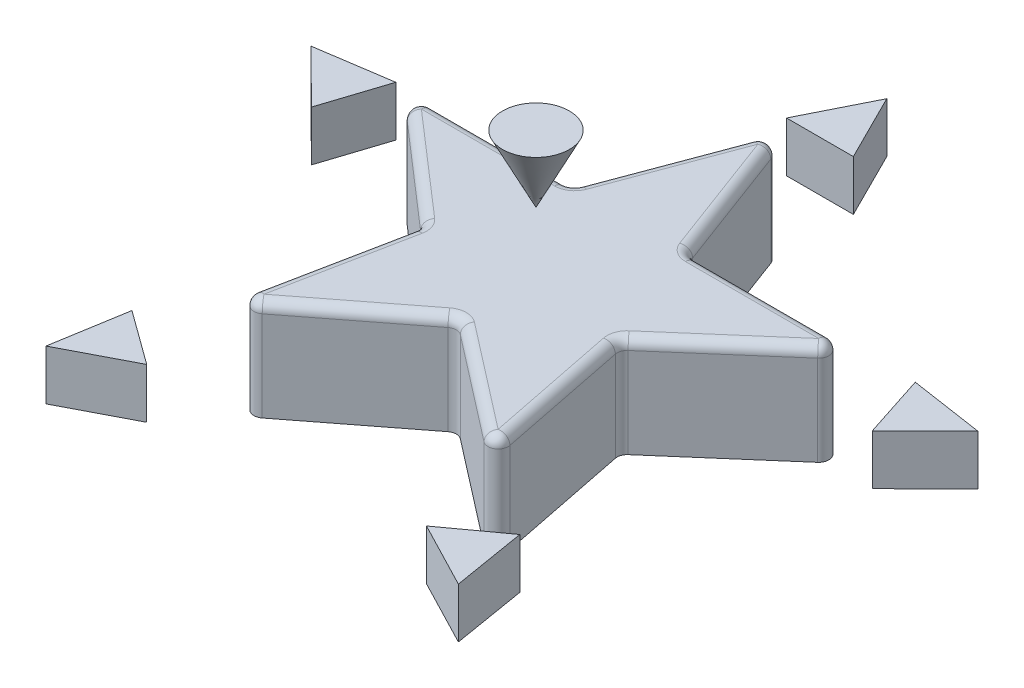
ISO-10303-21;
HEADER;
FILE_DESCRIPTION(('STEP AP214'),'2;1');
FILE_NAME('part.step','',(''),(''),'','','');
FILE_SCHEMA(('AUTOMOTIVE_DESIGN { 1 0 10303 214 1 1 1 1 }'));
ENDSEC;
DATA;
#1=APPLICATION_CONTEXT('core data for automotive mechanical design processes');
#2=APPLICATION_PROTOCOL_DEFINITION('international standard','automotive_design',2000,#1);
#3=PRODUCT_CONTEXT('',#1,'mechanical');
#4=PRODUCT('Part','Part','',(#3));
#5=PRODUCT_RELATED_PRODUCT_CATEGORY('part','',(#4));
#6=PRODUCT_DEFINITION_FORMATION('','',#4);
#7=PRODUCT_DEFINITION_CONTEXT('part definition',#1,'design');
#8=PRODUCT_DEFINITION('design','',#6,#7);
#9=PRODUCT_DEFINITION_SHAPE('','',#8);
#10=(LENGTH_UNIT() NAMED_UNIT(*) SI_UNIT(.MILLI.,.METRE.));
#11=(NAMED_UNIT(*) PLANE_ANGLE_UNIT() SI_UNIT($,.RADIAN.));
#12=(NAMED_UNIT(*) SI_UNIT($,.STERADIAN.) SOLID_ANGLE_UNIT());
#13=UNCERTAINTY_MEASURE_WITH_UNIT(LENGTH_MEASURE(1.E-05),#10,'distance_accuracy_value','');
#14=(GEOMETRIC_REPRESENTATION_CONTEXT(3) GLOBAL_UNCERTAINTY_ASSIGNED_CONTEXT((#13)) GLOBAL_UNIT_ASSIGNED_CONTEXT((#10,
#11,#12)) REPRESENTATION_CONTEXT('',''));
#15=CARTESIAN_POINT('',(0.,0.,0.));
#16=DIRECTION('',(0.,0.,1.));
#17=DIRECTION('',(1.,0.,0.));
#18=AXIS2_PLACEMENT_3D('',#15,#16,#17);
#19=CARTESIAN_POINT('',(-99.8609342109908,7.5,-32.4467844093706));
#20=DIRECTION('',(0.148932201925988,0.,0.988847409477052));
#21=DIRECTION('',(0.988847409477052,0.,-0.148932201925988));
#22=AXIS2_PLACEMENT_3D('',#19,#20,#21);
#23=PLANE('',#22);
#24=DIRECTION('',(-0.988847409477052,0.,0.148932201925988));
#25=VECTOR('',#24,1.);
#26=CARTESIAN_POINT('',(-99.8609342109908,-7.5,-32.4467844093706));
#27=LINE('',#26,#25);
#28=CARTESIAN_POINT('',(-77.7496339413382,-7.5,-35.777009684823));
#29=VERTEX_POINT('',#28);
#30=CARTESIAN_POINT('',(-99.8609342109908,-7.5,-32.4467844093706));
#31=VERTEX_POINT('',#30);
#32=EDGE_CURVE('E99',#29,#31,#27,.T.);
#33=ORIENTED_EDGE('',*,*,#32,.T.);
#34=DIRECTION('',(0.,-1.,0.));
#35=VECTOR('',#34,1.);
#36=CARTESIAN_POINT('',(-99.8609342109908,7.5,-32.4467844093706));
#37=LINE('',#36,#35);
#38=CARTESIAN_POINT('',(-99.8609342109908,7.5,-32.4467844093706));
#39=VERTEX_POINT('',#38);
#40=EDGE_CURVE('E12',#39,#31,#37,.T.);
#41=ORIENTED_EDGE('',*,*,#40,.F.);
#42=DIRECTION('',(-0.988847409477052,0.,0.148932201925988));
#43=VECTOR('',#42,1.);
#44=CARTESIAN_POINT('',(-99.8609342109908,7.5,-32.4467844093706));
#45=LINE('',#44,#43);
#46=CARTESIAN_POINT('',(-77.7496339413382,7.5,-35.777009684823));
#47=VERTEX_POINT('',#46);
#48=EDGE_CURVE('E92',#47,#39,#45,.T.);
#49=ORIENTED_EDGE('',*,*,#48,.F.);
#50=DIRECTION('',(0.,-1.,0.));
#51=VECTOR('',#50,1.);
#52=CARTESIAN_POINT('',(-77.7496339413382,7.5,-35.777009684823));
#53=LINE('',#52,#51);
#54=EDGE_CURVE('E100',#47,#29,#53,.T.);
#55=ORIENTED_EDGE('',*,*,#54,.T.);
#56=EDGE_LOOP('',(#33,#41,#49,#55));
#57=FACE_BOUND('',#56,.T.);
#58=ADVANCED_FACE('F52',(#57),#23,.F.);
#59=CARTESIAN_POINT('',(-83.9299738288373,7.5,-16.75587935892));
#60=DIRECTION('',(0.701718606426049,0.,-0.712454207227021));
#61=DIRECTION('',(-0.712454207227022,0.,-0.701718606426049));
#62=AXIS2_PLACEMENT_3D('',#59,#60,#61);
#63=PLANE('',#62);
#64=DIRECTION('',(0.712454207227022,0.,0.701718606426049));
#65=VECTOR('',#64,1.);
#66=CARTESIAN_POINT('',(-83.9299738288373,-7.5,-16.75587935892));
#67=LINE('',#66,#65);
#68=CARTESIAN_POINT('',(-83.9299738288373,-7.5,-16.75587935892));
#69=VERTEX_POINT('',#68);
#70=EDGE_CURVE('E80',#31,#69,#67,.T.);
#71=ORIENTED_EDGE('',*,*,#70,.T.);
#72=DIRECTION('',(0.,-1.,0.));
#73=VECTOR('',#72,1.);
#74=CARTESIAN_POINT('',(-83.9299738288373,7.5,-16.75587935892));
#75=LINE('',#74,#73);
#76=CARTESIAN_POINT('',(-83.9299738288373,7.5,-16.75587935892));
#77=VERTEX_POINT('',#76);
#78=EDGE_CURVE('E60',#77,#69,#75,.T.);
#79=ORIENTED_EDGE('',*,*,#78,.F.);
#80=DIRECTION('',(0.712454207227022,0.,0.701718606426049));
#81=VECTOR('',#80,1.);
#82=CARTESIAN_POINT('',(-83.9299738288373,7.5,-16.75587935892));
#83=LINE('',#82,#81);
#84=EDGE_CURVE('E88',#39,#77,#83,.T.);
#85=ORIENTED_EDGE('',*,*,#84,.F.);
#86=ORIENTED_EDGE('',*,*,#40,.T.);
#87=EDGE_LOOP('',(#71,#79,#85,#86));
#88=FACE_BOUND('',#87,.T.);
#89=ADVANCED_FACE('F89',(#88),#63,.F.);
#90=CARTESIAN_POINT('',(-77.7496339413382,7.5,-35.777009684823));
#91=DIRECTION('',(-0.95105651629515,0.,-0.309016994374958));
#92=DIRECTION('',(-0.309016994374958,0.,0.95105651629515));
#93=AXIS2_PLACEMENT_3D('',#90,#91,#92);
#94=PLANE('',#93);
#95=DIRECTION('',(0.309016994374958,0.,-0.95105651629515));
#96=VECTOR('',#95,1.);
#97=CARTESIAN_POINT('',(-77.7496339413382,-7.5,-35.777009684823));
#98=LINE('',#97,#96);
#99=EDGE_CURVE('E85',#69,#29,#98,.T.);
#100=ORIENTED_EDGE('',*,*,#99,.T.);
#101=ORIENTED_EDGE('',*,*,#54,.F.);
#102=DIRECTION('',(0.309016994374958,0.,-0.95105651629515));
#103=VECTOR('',#102,1.);
#104=CARTESIAN_POINT('',(-77.7496339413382,7.5,-35.777009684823));
#105=LINE('',#104,#103);
#106=EDGE_CURVE('E68',#77,#47,#105,.T.);
#107=ORIENTED_EDGE('',*,*,#106,.F.);
#108=ORIENTED_EDGE('',*,*,#78,.T.);
#109=EDGE_LOOP('',(#100,#101,#107,#108));
#110=FACE_BOUND('',#109,.T.);
#111=ADVANCED_FACE('F107',(#110),#94,.F.);
#112=CARTESIAN_POINT('',(0.,7.5,0.));
#113=DIRECTION('',(0.,-1.,0.));
#114=DIRECTION('',(-0.95105651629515,0.,-0.309016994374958));
#115=AXIS2_PLACEMENT_3D('',#112,#113,#114);
#116=PLANE('',#115);
#117=ORIENTED_EDGE('',*,*,#48,.T.);
#118=ORIENTED_EDGE('',*,*,#84,.T.);
#119=ORIENTED_EDGE('',*,*,#106,.T.);
#120=EDGE_LOOP('',(#117,#118,#119));
#121=FACE_BOUND('',#120,.T.);
#122=ADVANCED_FACE('F95',(#121),#116,.F.);
#123=CARTESIAN_POINT('',(0.,-7.5,0.));
#124=DIRECTION('',(0.,-1.,0.));
#125=DIRECTION('',(-0.95105651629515,0.,-0.309016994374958));
#126=AXIS2_PLACEMENT_3D('',#123,#124,#125);
#127=PLANE('',#126);
#128=ORIENTED_EDGE('',*,*,#32,.F.);
#129=ORIENTED_EDGE('',*,*,#99,.F.);
#130=ORIENTED_EDGE('',*,*,#70,.F.);
#131=EDGE_LOOP('',(#128,#129,#130));
#132=FACE_BOUND('',#131,.T.);
#133=ADVANCED_FACE('F108',(#132),#127,.T.);
#134=CLOSED_SHELL('',(#58,#89,#111,#122,#133));
#135=MANIFOLD_SOLID_BREP('B2',#134);
#136=CARTESIAN_POINT('',(-61.7174514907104,7.5,84.9467844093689));
#137=DIRECTION('',(0.986472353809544,0.,0.163927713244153));
#138=DIRECTION('',(0.163927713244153,0.,-0.986472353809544));
#139=AXIS2_PLACEMENT_3D('',#136,#137,#138);
#140=PLANE('',#139);
#141=DIRECTION('',(-0.163927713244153,0.,0.986472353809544));
#142=VECTOR('',#141,1.);
#143=CARTESIAN_POINT('',(-61.7174514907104,-7.5,84.9467844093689));
#144=LINE('',#143,#142);
#145=CARTESIAN_POINT('',(-58.0519163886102,-7.5,62.8885919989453));
#146=VERTEX_POINT('',#145);
#147=CARTESIAN_POINT('',(-61.7174514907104,-7.5,84.9467844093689));
#148=VERTEX_POINT('',#147);
#149=EDGE_CURVE('E217',#146,#148,#144,.T.);
#150=ORIENTED_EDGE('',*,*,#149,.T.);
#151=DIRECTION('',(0.,-1.,0.));
#152=VECTOR('',#151,1.);
#153=CARTESIAN_POINT('',(-61.7174514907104,7.5,84.9467844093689));
#154=LINE('',#153,#152);
#155=CARTESIAN_POINT('',(-61.7174514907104,7.5,84.9467844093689));
#156=VERTEX_POINT('',#155);
#157=EDGE_CURVE('E50',#156,#148,#154,.T.);
#158=ORIENTED_EDGE('',*,*,#157,.F.);
#159=DIRECTION('',(-0.163927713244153,0.,0.986472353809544));
#160=VECTOR('',#159,1.);
#161=CARTESIAN_POINT('',(-61.7174514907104,7.5,84.9467844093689));
#162=LINE('',#161,#160);
#163=CARTESIAN_POINT('',(-58.0519163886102,7.5,62.8885919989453));
#164=VERTEX_POINT('',#163);
#165=EDGE_CURVE('E210',#164,#156,#162,.T.);
#166=ORIENTED_EDGE('',*,*,#165,.F.);
#167=DIRECTION('',(0.,-1.,0.));
#168=VECTOR('',#167,1.);
#169=CARTESIAN_POINT('',(-58.0519163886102,7.5,62.8885919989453));
#170=LINE('',#169,#168);
#171=EDGE_CURVE('E218',#164,#146,#170,.T.);
#172=ORIENTED_EDGE('',*,*,#171,.T.);
#173=EDGE_LOOP('',(#150,#158,#166,#172));
#174=FACE_BOUND('',#173,.T.);
#175=ADVANCED_FACE('F170',(#174),#140,.F.);
#176=CARTESIAN_POINT('',(-41.8715765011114,7.5,74.6442970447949));
#177=DIRECTION('',(-0.460741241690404,0.,-0.887534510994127));
#178=DIRECTION('',(-0.887534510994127,0.,0.460741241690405));
#179=AXIS2_PLACEMENT_3D('',#176,#177,#178);
#180=PLANE('',#179);
#181=DIRECTION('',(0.887534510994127,0.,-0.460741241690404));
#182=VECTOR('',#181,1.);
#183=CARTESIAN_POINT('',(-41.8715765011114,-7.5,74.6442970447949));
#184=LINE('',#183,#182);
#185=CARTESIAN_POINT('',(-41.8715765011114,-7.5,74.6442970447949));
#186=VERTEX_POINT('',#185);
#187=EDGE_CURVE('E198',#148,#186,#184,.T.);
#188=ORIENTED_EDGE('',*,*,#187,.T.);
#189=DIRECTION('',(0.,-1.,0.));
#190=VECTOR('',#189,1.);
#191=CARTESIAN_POINT('',(-41.8715765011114,7.5,74.6442970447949));
#192=LINE('',#191,#190);
#193=CARTESIAN_POINT('',(-41.8715765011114,7.5,74.6442970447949));
#194=VERTEX_POINT('',#193);
#195=EDGE_CURVE('E178',#194,#186,#192,.T.);
#196=ORIENTED_EDGE('',*,*,#195,.F.);
#197=DIRECTION('',(0.887534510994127,0.,-0.460741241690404));
#198=VECTOR('',#197,1.);
#199=CARTESIAN_POINT('',(-41.8715765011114,7.5,74.6442970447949));
#200=LINE('',#199,#198);
#201=EDGE_CURVE('E206',#156,#194,#200,.T.);
#202=ORIENTED_EDGE('',*,*,#201,.F.);
#203=ORIENTED_EDGE('',*,*,#157,.T.);
#204=EDGE_LOOP('',(#188,#196,#202,#203));
#205=FACE_BOUND('',#204,.T.);
#206=ADVANCED_FACE('F207',(#205),#180,.F.);
#207=CARTESIAN_POINT('',(-58.0519163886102,7.5,62.8885919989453));
#208=DIRECTION('',(-0.58778525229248,0.,0.809016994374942));
#209=DIRECTION('',(0.809016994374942,0.,0.58778525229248));
#210=AXIS2_PLACEMENT_3D('',#207,#208,#209);
#211=PLANE('',#210);
#212=DIRECTION('',(-0.809016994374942,0.,-0.58778525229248));
#213=VECTOR('',#212,1.);
#214=CARTESIAN_POINT('',(-58.0519163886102,-7.5,62.8885919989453));
#215=LINE('',#214,#213);
#216=EDGE_CURVE('E203',#186,#146,#215,.T.);
#217=ORIENTED_EDGE('',*,*,#216,.T.);
#218=ORIENTED_EDGE('',*,*,#171,.F.);
#219=DIRECTION('',(-0.809016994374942,0.,-0.58778525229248));
#220=VECTOR('',#219,1.);
#221=CARTESIAN_POINT('',(-58.0519163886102,7.5,62.8885919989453));
#222=LINE('',#221,#220);
#223=EDGE_CURVE('E186',#194,#164,#222,.T.);
#224=ORIENTED_EDGE('',*,*,#223,.F.);
#225=ORIENTED_EDGE('',*,*,#195,.T.);
#226=EDGE_LOOP('',(#217,#218,#224,#225));
#227=FACE_BOUND('',#226,.T.);
#228=ADVANCED_FACE('F225',(#227),#211,.F.);
#229=CARTESIAN_POINT('',(0.,7.5,0.));
#230=DIRECTION('',(0.,-1.,0.));
#231=DIRECTION('',(-0.58778525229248,0.,0.809016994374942));
#232=AXIS2_PLACEMENT_3D('',#229,#230,#231);
#233=PLANE('',#232);
#234=ORIENTED_EDGE('',*,*,#165,.T.);
#235=ORIENTED_EDGE('',*,*,#201,.T.);
#236=ORIENTED_EDGE('',*,*,#223,.T.);
#237=EDGE_LOOP('',(#234,#235,#236));
#238=FACE_BOUND('',#237,.T.);
#239=ADVANCED_FACE('F213',(#238),#233,.F.);
#240=CARTESIAN_POINT('',(0.,-7.5,0.));
#241=DIRECTION('',(0.,-1.,0.));
#242=DIRECTION('',(-0.58778525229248,0.,0.809016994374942));
#243=AXIS2_PLACEMENT_3D('',#240,#241,#242);
#244=PLANE('',#243);
#245=ORIENTED_EDGE('',*,*,#149,.F.);
#246=ORIENTED_EDGE('',*,*,#216,.F.);
#247=ORIENTED_EDGE('',*,*,#187,.F.);
#248=EDGE_LOOP('',(#245,#246,#247));
#249=FACE_BOUND('',#248,.T.);
#250=ADVANCED_FACE('F226',(#249),#244,.T.);
#251=CLOSED_SHELL('',(#175,#206,#228,#239,#250));
#252=MANIFOLD_SOLID_BREP('B6',#251);
#253=CARTESIAN_POINT('',(61.7174514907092,7.5,84.9467844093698));
#254=DIRECTION('',(0.460741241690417,0.,-0.88753451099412));
#255=DIRECTION('',(-0.887534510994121,0.,-0.460741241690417));
#256=AXIS2_PLACEMENT_3D('',#253,#254,#255);
#257=PLANE('',#256);
#258=DIRECTION('',(0.887534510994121,0.,0.460741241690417));
#259=VECTOR('',#258,1.);
#260=CARTESIAN_POINT('',(61.7174514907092,-7.5,84.9467844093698));
#261=LINE('',#260,#259);
#262=CARTESIAN_POINT('',(41.8715765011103,-7.5,74.6442970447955));
#263=VERTEX_POINT('',#262);
#264=CARTESIAN_POINT('',(61.7174514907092,-7.5,84.9467844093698));
#265=VERTEX_POINT('',#264);
#266=EDGE_CURVE('E335',#263,#265,#261,.T.);
#267=ORIENTED_EDGE('',*,*,#266,.T.);
#268=DIRECTION('',(0.,-1.,0.));
#269=VECTOR('',#268,1.);
#270=CARTESIAN_POINT('',(61.7174514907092,7.5,84.9467844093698));
#271=LINE('',#270,#269);
#272=CARTESIAN_POINT('',(61.7174514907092,7.5,84.9467844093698));
#273=VERTEX_POINT('',#272);
#274=EDGE_CURVE('E168',#273,#265,#271,.T.);
#275=ORIENTED_EDGE('',*,*,#274,.F.);
#276=DIRECTION('',(0.887534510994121,0.,0.460741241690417));
#277=VECTOR('',#276,1.);
#278=CARTESIAN_POINT('',(61.7174514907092,7.5,84.9467844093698));
#279=LINE('',#278,#277);
#280=CARTESIAN_POINT('',(41.8715765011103,7.5,74.6442970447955));
#281=VERTEX_POINT('',#280);
#282=EDGE_CURVE('E328',#281,#273,#279,.T.);
#283=ORIENTED_EDGE('',*,*,#282,.F.);
#284=DIRECTION('',(0.,-1.,0.));
#285=VECTOR('',#284,1.);
#286=CARTESIAN_POINT('',(41.8715765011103,7.5,74.6442970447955));
#287=LINE('',#286,#285);
#288=EDGE_CURVE('E336',#281,#263,#287,.T.);
#289=ORIENTED_EDGE('',*,*,#288,.T.);
#290=EDGE_LOOP('',(#267,#275,#283,#289));
#291=FACE_BOUND('',#290,.T.);
#292=ADVANCED_FACE('F288',(#291),#257,.F.);
#293=CARTESIAN_POINT('',(58.0519163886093,7.5,62.8885919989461));
#294=DIRECTION('',(-0.986472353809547,0.,0.163927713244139));
#295=DIRECTION('',(0.163927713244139,0.,0.986472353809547));
#296=AXIS2_PLACEMENT_3D('',#293,#294,#295);
#297=PLANE('',#296);
#298=DIRECTION('',(-0.163927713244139,0.,-0.986472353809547));
#299=VECTOR('',#298,1.);
#300=CARTESIAN_POINT('',(58.0519163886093,-7.5,62.8885919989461));
#301=LINE('',#300,#299);
#302=CARTESIAN_POINT('',(58.0519163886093,-7.5,62.8885919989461));
#303=VERTEX_POINT('',#302);
#304=EDGE_CURVE('E316',#265,#303,#301,.T.);
#305=ORIENTED_EDGE('',*,*,#304,.T.);
#306=DIRECTION('',(0.,-1.,0.));
#307=VECTOR('',#306,1.);
#308=CARTESIAN_POINT('',(58.0519163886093,7.5,62.8885919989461));
#309=LINE('',#308,#307);
#310=CARTESIAN_POINT('',(58.0519163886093,7.5,62.8885919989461));
#311=VERTEX_POINT('',#310);
#312=EDGE_CURVE('E296',#311,#303,#309,.T.);
#313=ORIENTED_EDGE('',*,*,#312,.F.);
#314=DIRECTION('',(-0.163927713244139,0.,-0.986472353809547));
#315=VECTOR('',#314,1.);
#316=CARTESIAN_POINT('',(58.0519163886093,7.5,62.8885919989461));
#317=LINE('',#316,#315);
#318=EDGE_CURVE('E324',#273,#311,#317,.T.);
#319=ORIENTED_EDGE('',*,*,#318,.F.);
#320=ORIENTED_EDGE('',*,*,#274,.T.);
#321=EDGE_LOOP('',(#305,#313,#319,#320));
#322=FACE_BOUND('',#321,.T.);
#323=ADVANCED_FACE('F325',(#322),#297,.F.);
#324=CARTESIAN_POINT('',(41.8715765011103,7.5,74.6442970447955));
#325=DIRECTION('',(0.587785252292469,0.,0.809016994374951));
#326=DIRECTION('',(0.809016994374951,0.,-0.587785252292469));
#327=AXIS2_PLACEMENT_3D('',#324,#325,#326);
#328=PLANE('',#327);
#329=DIRECTION('',(-0.809016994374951,0.,0.587785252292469));
#330=VECTOR('',#329,1.);
#331=CARTESIAN_POINT('',(41.8715765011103,-7.5,74.6442970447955));
#332=LINE('',#331,#330);
#333=EDGE_CURVE('E321',#303,#263,#332,.T.);
#334=ORIENTED_EDGE('',*,*,#333,.T.);
#335=ORIENTED_EDGE('',*,*,#288,.F.);
#336=DIRECTION('',(-0.809016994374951,0.,0.587785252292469));
#337=VECTOR('',#336,1.);
#338=CARTESIAN_POINT('',(41.8715765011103,7.5,74.6442970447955));
#339=LINE('',#338,#337);
#340=EDGE_CURVE('E304',#311,#281,#339,.T.);
#341=ORIENTED_EDGE('',*,*,#340,.F.);
#342=ORIENTED_EDGE('',*,*,#312,.T.);
#343=EDGE_LOOP('',(#334,#335,#341,#342));
#344=FACE_BOUND('',#343,.T.);
#345=ADVANCED_FACE('F343',(#344),#328,.F.);
#346=CARTESIAN_POINT('',(0.,7.5,0.));
#347=DIRECTION('',(0.,-1.,0.));
#348=DIRECTION('',(0.587785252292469,0.,0.809016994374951));
#349=AXIS2_PLACEMENT_3D('',#346,#347,#348);
#350=PLANE('',#349);
#351=ORIENTED_EDGE('',*,*,#282,.T.);
#352=ORIENTED_EDGE('',*,*,#318,.T.);
#353=ORIENTED_EDGE('',*,*,#340,.T.);
#354=EDGE_LOOP('',(#351,#352,#353));
#355=FACE_BOUND('',#354,.T.);
#356=ADVANCED_FACE('F331',(#355),#350,.F.);
#357=CARTESIAN_POINT('',(0.,-7.5,0.));
#358=DIRECTION('',(0.,-1.,0.));
#359=DIRECTION('',(0.587785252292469,0.,0.809016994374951));
#360=AXIS2_PLACEMENT_3D('',#357,#358,#359);
#361=PLANE('',#360);
#362=ORIENTED_EDGE('',*,*,#266,.F.);
#363=ORIENTED_EDGE('',*,*,#333,.F.);
#364=ORIENTED_EDGE('',*,*,#304,.F.);
#365=EDGE_LOOP('',(#362,#363,#364));
#366=FACE_BOUND('',#365,.T.);
#367=ADVANCED_FACE('F344',(#366),#361,.T.);
#368=CLOSED_SHELL('',(#292,#323,#345,#356,#367));
#369=MANIFOLD_SOLID_BREP('B44',#368);
#370=CARTESIAN_POINT('',(99.8609342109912,7.5,-32.4467844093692));
#371=DIRECTION('',(-0.701718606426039,0.,-0.712454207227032));
#372=DIRECTION('',(-0.712454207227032,0.,0.701718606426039));
#373=AXIS2_PLACEMENT_3D('',#370,#371,#372);
#374=PLANE('',#373);
#375=DIRECTION('',(0.712454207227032,0.,-0.701718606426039));
#376=VECTOR('',#375,1.);
#377=CARTESIAN_POINT('',(99.8609342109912,-7.5,-32.4467844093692));
#378=LINE('',#377,#376);
#379=CARTESIAN_POINT('',(83.9299738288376,-7.5,-16.7558793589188));
#380=VERTEX_POINT('',#379);
#381=CARTESIAN_POINT('',(99.8609342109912,-7.5,-32.4467844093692));
#382=VERTEX_POINT('',#381);
#383=EDGE_CURVE('E453',#380,#382,#378,.T.);
#384=ORIENTED_EDGE('',*,*,#383,.T.);
#385=DIRECTION('',(0.,-1.,0.));
#386=VECTOR('',#385,1.);
#387=CARTESIAN_POINT('',(99.8609342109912,7.5,-32.4467844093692));
#388=LINE('',#387,#386);
#389=CARTESIAN_POINT('',(99.8609342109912,7.5,-32.4467844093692));
#390=VERTEX_POINT('',#389);
#391=EDGE_CURVE('E286',#390,#382,#388,.T.);
#392=ORIENTED_EDGE('',*,*,#391,.F.);
#393=DIRECTION('',(0.712454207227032,0.,-0.701718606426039));
#394=VECTOR('',#393,1.);
#395=CARTESIAN_POINT('',(99.8609342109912,7.5,-32.4467844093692));
#396=LINE('',#395,#394);
#397=CARTESIAN_POINT('',(83.9299738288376,7.5,-16.7558793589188));
#398=VERTEX_POINT('',#397);
#399=EDGE_CURVE('E446',#398,#390,#396,.T.);
#400=ORIENTED_EDGE('',*,*,#399,.F.);
#401=DIRECTION('',(0.,-1.,0.));
#402=VECTOR('',#401,1.);
#403=CARTESIAN_POINT('',(83.9299738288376,7.5,-16.7558793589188));
#404=LINE('',#403,#402);
#405=EDGE_CURVE('E454',#398,#380,#404,.T.);
#406=ORIENTED_EDGE('',*,*,#405,.T.);
#407=EDGE_LOOP('',(#384,#392,#400,#406));
#408=FACE_BOUND('',#407,.T.);
#409=ADVANCED_FACE('F406',(#408),#374,.F.);
#410=CARTESIAN_POINT('',(77.7496339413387,7.5,-35.7770096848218));
#411=DIRECTION('',(-0.148932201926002,0.,0.98884740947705));
#412=DIRECTION('',(0.98884740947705,0.,0.148932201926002));
#413=AXIS2_PLACEMENT_3D('',#410,#411,#412);
#414=PLANE('',#413);
#415=DIRECTION('',(-0.98884740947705,0.,-0.148932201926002));
#416=VECTOR('',#415,1.);
#417=CARTESIAN_POINT('',(77.7496339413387,-7.5,-35.7770096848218));
#418=LINE('',#417,#416);
#419=CARTESIAN_POINT('',(77.7496339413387,-7.5,-35.7770096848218));
#420=VERTEX_POINT('',#419);
#421=EDGE_CURVE('E434',#382,#420,#418,.T.);
#422=ORIENTED_EDGE('',*,*,#421,.T.);
#423=DIRECTION('',(0.,-1.,0.));
#424=VECTOR('',#423,1.);
#425=CARTESIAN_POINT('',(77.7496339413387,7.5,-35.7770096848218));
#426=LINE('',#425,#424);
#427=CARTESIAN_POINT('',(77.7496339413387,7.5,-35.7770096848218));
#428=VERTEX_POINT('',#427);
#429=EDGE_CURVE('E414',#428,#420,#426,.T.);
#430=ORIENTED_EDGE('',*,*,#429,.F.);
#431=DIRECTION('',(-0.98884740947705,0.,-0.148932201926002));
#432=VECTOR('',#431,1.);
#433=CARTESIAN_POINT('',(77.7496339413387,7.5,-35.7770096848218));
#434=LINE('',#433,#432);
#435=EDGE_CURVE('E442',#390,#428,#434,.T.);
#436=ORIENTED_EDGE('',*,*,#435,.F.);
#437=ORIENTED_EDGE('',*,*,#391,.T.);
#438=EDGE_LOOP('',(#422,#430,#436,#437));
#439=FACE_BOUND('',#438,.T.);
#440=ADVANCED_FACE('F443',(#439),#414,.F.);
#441=CARTESIAN_POINT('',(83.9299738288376,7.5,-16.7558793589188));
#442=DIRECTION('',(0.951056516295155,0.,-0.309016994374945));
#443=DIRECTION('',(-0.309016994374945,0.,-0.951056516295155));
#444=AXIS2_PLACEMENT_3D('',#441,#442,#443);
#445=PLANE('',#444);
#446=DIRECTION('',(0.309016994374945,0.,0.951056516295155));
#447=VECTOR('',#446,1.);
#448=CARTESIAN_POINT('',(83.9299738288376,-7.5,-16.7558793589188));
#449=LINE('',#448,#447);
#450=EDGE_CURVE('E439',#420,#380,#449,.T.);
#451=ORIENTED_EDGE('',*,*,#450,.T.);
#452=ORIENTED_EDGE('',*,*,#405,.F.);
#453=DIRECTION('',(0.309016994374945,0.,0.951056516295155));
#454=VECTOR('',#453,1.);
#455=CARTESIAN_POINT('',(83.9299738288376,7.5,-16.7558793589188));
#456=LINE('',#455,#454);
#457=EDGE_CURVE('E422',#428,#398,#456,.T.);
#458=ORIENTED_EDGE('',*,*,#457,.F.);
#459=ORIENTED_EDGE('',*,*,#429,.T.);
#460=EDGE_LOOP('',(#451,#452,#458,#459));
#461=FACE_BOUND('',#460,.T.);
#462=ADVANCED_FACE('F461',(#461),#445,.F.);
#463=CARTESIAN_POINT('',(0.,7.5,0.));
#464=DIRECTION('',(0.,-1.,0.));
#465=DIRECTION('',(0.951056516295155,0.,-0.309016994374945));
#466=AXIS2_PLACEMENT_3D('',#463,#464,#465);
#467=PLANE('',#466);
#468=ORIENTED_EDGE('',*,*,#399,.T.);
#469=ORIENTED_EDGE('',*,*,#435,.T.);
#470=ORIENTED_EDGE('',*,*,#457,.T.);
#471=EDGE_LOOP('',(#468,#469,#470));
#472=FACE_BOUND('',#471,.T.);
#473=ADVANCED_FACE('F449',(#472),#467,.F.);
#474=CARTESIAN_POINT('',(0.,-7.5,0.));
#475=DIRECTION('',(0.,-1.,0.));
#476=DIRECTION('',(0.951056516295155,0.,-0.309016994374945));
#477=AXIS2_PLACEMENT_3D('',#474,#475,#476);
#478=PLANE('',#477);
#479=ORIENTED_EDGE('',*,*,#383,.F.);
#480=ORIENTED_EDGE('',*,*,#450,.F.);
#481=ORIENTED_EDGE('',*,*,#421,.F.);
#482=EDGE_LOOP('',(#479,#480,#481));
#483=FACE_BOUND('',#482,.T.);
#484=ADVANCED_FACE('F462',(#483),#478,.T.);
#485=CLOSED_SHELL('',(#409,#440,#462,#473,#484));
#486=MANIFOLD_SOLID_BREP('B162',#485);
#487=CARTESIAN_POINT('',(0.,7.5,-105.));
#488=DIRECTION('',(-0.894427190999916,0.,0.447213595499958));
#489=DIRECTION('',(0.447213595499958,0.,0.894427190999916));
#490=AXIS2_PLACEMENT_3D('',#487,#488,#489);
#491=PLANE('',#490);
#492=DIRECTION('',(-0.447213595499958,0.,-0.894427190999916));
#493=VECTOR('',#492,1.);
#494=CARTESIAN_POINT('',(0.,-7.5,-105.));
#495=LINE('',#494,#493);
#496=CARTESIAN_POINT('',(10.,-7.5,-85.));
#497=VERTEX_POINT('',#496);
#498=CARTESIAN_POINT('',(0.,-7.5,-105.));
#499=VERTEX_POINT('',#498);
#500=EDGE_CURVE('E571',#497,#499,#495,.T.);
#501=ORIENTED_EDGE('',*,*,#500,.T.);
#502=DIRECTION('',(0.,-1.,0.));
#503=VECTOR('',#502,1.);
#504=CARTESIAN_POINT('',(0.,7.5,-105.));
#505=LINE('',#504,#503);
#506=CARTESIAN_POINT('',(0.,7.5,-105.));
#507=VERTEX_POINT('',#506);
#508=EDGE_CURVE('E404',#507,#499,#505,.T.);
#509=ORIENTED_EDGE('',*,*,#508,.F.);
#510=DIRECTION('',(-0.447213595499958,0.,-0.894427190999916));
#511=VECTOR('',#510,1.);
#512=CARTESIAN_POINT('',(0.,7.5,-105.));
#513=LINE('',#512,#511);
#514=CARTESIAN_POINT('',(10.,7.5,-85.));
#515=VERTEX_POINT('',#514);
#516=EDGE_CURVE('E564',#515,#507,#513,.T.);
#517=ORIENTED_EDGE('',*,*,#516,.F.);
#518=DIRECTION('',(0.,-1.,0.));
#519=VECTOR('',#518,1.);
#520=CARTESIAN_POINT('',(10.,7.5,-85.));
#521=LINE('',#520,#519);
#522=EDGE_CURVE('E572',#515,#497,#521,.T.);
#523=ORIENTED_EDGE('',*,*,#522,.T.);
#524=EDGE_LOOP('',(#501,#509,#517,#523));
#525=FACE_BOUND('',#524,.T.);
#526=ADVANCED_FACE('F524',(#525),#491,.F.);
#527=CARTESIAN_POINT('',(-10.,7.5,-85.));
#528=DIRECTION('',(0.894427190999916,0.,0.447213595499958));
#529=DIRECTION('',(0.447213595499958,0.,-0.894427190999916));
#530=AXIS2_PLACEMENT_3D('',#527,#528,#529);
#531=PLANE('',#530);
#532=DIRECTION('',(-0.447213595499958,0.,0.894427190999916));
#533=VECTOR('',#532,1.);
#534=CARTESIAN_POINT('',(-10.,-7.5,-85.));
#535=LINE('',#534,#533);
#536=CARTESIAN_POINT('',(-10.,-7.5,-85.));
#537=VERTEX_POINT('',#536);
#538=EDGE_CURVE('E552',#499,#537,#535,.T.);
#539=ORIENTED_EDGE('',*,*,#538,.T.);
#540=DIRECTION('',(0.,-1.,0.));
#541=VECTOR('',#540,1.);
#542=CARTESIAN_POINT('',(-10.,7.5,-85.));
#543=LINE('',#542,#541);
#544=CARTESIAN_POINT('',(-10.,7.5,-85.));
#545=VERTEX_POINT('',#544);
#546=EDGE_CURVE('E532',#545,#537,#543,.T.);
#547=ORIENTED_EDGE('',*,*,#546,.F.);
#548=DIRECTION('',(-0.447213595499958,0.,0.894427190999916));
#549=VECTOR('',#548,1.);
#550=CARTESIAN_POINT('',(-10.,7.5,-85.));
#551=LINE('',#550,#549);
#552=EDGE_CURVE('E560',#507,#545,#551,.T.);
#553=ORIENTED_EDGE('',*,*,#552,.F.);
#554=ORIENTED_EDGE('',*,*,#508,.T.);
#555=EDGE_LOOP('',(#539,#547,#553,#554));
#556=FACE_BOUND('',#555,.T.);
#557=ADVANCED_FACE('F561',(#556),#531,.F.);
#558=CARTESIAN_POINT('',(10.,7.5,-85.));
#559=DIRECTION('',(0.,0.,-1.));
#560=DIRECTION('',(-1.,0.,0.));
#561=AXIS2_PLACEMENT_3D('',#558,#559,#560);
#562=PLANE('',#561);
#563=DIRECTION('',(1.,0.,0.));
#564=VECTOR('',#563,1.);
#565=CARTESIAN_POINT('',(10.,-7.5,-85.));
#566=LINE('',#565,#564);
#567=EDGE_CURVE('E557',#537,#497,#566,.T.);
#568=ORIENTED_EDGE('',*,*,#567,.T.);
#569=ORIENTED_EDGE('',*,*,#522,.F.);
#570=DIRECTION('',(1.,0.,0.));
#571=VECTOR('',#570,1.);
#572=CARTESIAN_POINT('',(10.,7.5,-85.));
#573=LINE('',#572,#571);
#574=EDGE_CURVE('E540',#545,#515,#573,.T.);
#575=ORIENTED_EDGE('',*,*,#574,.F.);
#576=ORIENTED_EDGE('',*,*,#546,.T.);
#577=EDGE_LOOP('',(#568,#569,#575,#576));
#578=FACE_BOUND('',#577,.T.);
#579=ADVANCED_FACE('F579',(#578),#562,.F.);
#580=CARTESIAN_POINT('',(0.,7.5,0.));
#581=DIRECTION('',(0.,-1.,0.));
#582=DIRECTION('',(0.,0.,-1.));
#583=AXIS2_PLACEMENT_3D('',#580,#581,#582);
#584=PLANE('',#583);
#585=ORIENTED_EDGE('',*,*,#516,.T.);
#586=ORIENTED_EDGE('',*,*,#552,.T.);
#587=ORIENTED_EDGE('',*,*,#574,.T.);
#588=EDGE_LOOP('',(#585,#586,#587));
#589=FACE_BOUND('',#588,.T.);
#590=ADVANCED_FACE('F567',(#589),#584,.F.);
#591=CARTESIAN_POINT('',(0.,-7.5,0.));
#592=DIRECTION('',(0.,-1.,0.));
#593=DIRECTION('',(0.,0.,-1.));
#594=AXIS2_PLACEMENT_3D('',#591,#592,#593);
#595=PLANE('',#594);
#596=ORIENTED_EDGE('',*,*,#500,.F.);
#597=ORIENTED_EDGE('',*,*,#567,.F.);
#598=ORIENTED_EDGE('',*,*,#538,.F.);
#599=EDGE_LOOP('',(#596,#597,#598));
#600=FACE_BOUND('',#599,.T.);
#601=ADVANCED_FACE('F580',(#600),#595,.T.);
#602=CLOSED_SHELL('',(#526,#557,#579,#590,#601));
#603=MANIFOLD_SOLID_BREP('B280',#602);
#604=CARTESIAN_POINT('',(0.,51.8377675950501,0.));
#605=DIRECTION('',(0.,1.,0.));
#606=DIRECTION('',(0.,0.,1.));
#607=AXIS2_PLACEMENT_3D('',#604,#605,#606);
#608=PLANE('',#607);
#609=CARTESIAN_POINT('',(0.,51.8377675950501,0.));
#610=DIRECTION('',(0.,-1.,0.));
#611=DIRECTION('',(0.,0.,-1.));
#612=AXIS2_PLACEMENT_3D('',#609,#610,#611);
#613=CIRCLE('',#612,10.);
#614=CARTESIAN_POINT('',(0.,51.8377675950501,-10.));
#615=VERTEX_POINT('',#614);
#616=EDGE_CURVE('E522',#615,#615,#613,.T.);
#617=ORIENTED_EDGE('',*,*,#616,.F.);
#618=EDGE_LOOP('',(#617));
#619=FACE_BOUND('',#618,.T.);
#620=ADVANCED_FACE('F631',(#619),#608,.T.);
#621=CARTESIAN_POINT('',(0.,31.8377675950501,0.));
#622=DIRECTION('',(0.,1.,0.));
#623=DIRECTION('',(0.,0.,1.));
#624=AXIS2_PLACEMENT_3D('',#621,#622,#623);
#625=CONICAL_SURFACE('',#624,0.,0.463647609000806);
#626=ORIENTED_EDGE('',*,*,#616,.T.);
#627=EDGE_LOOP('',(#626));
#628=FACE_BOUND('',#627,.T.);
#629=CARTESIAN_POINT('',(0.,31.8377675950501,0.));
#630=VERTEX_POINT('',#629);
#631=VERTEX_LOOP('',#630);
#632=FACE_BOUND('',#631,.T.);
#633=ADVANCED_FACE('F638',(#628,#632),#625,.T.);
#634=CLOSED_SHELL('',(#620,#633));
#635=MANIFOLD_SOLID_BREP('B398',#634);
#636=CARTESIAN_POINT('',(17.5,15.,-28.162515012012));
#637=DIRECTION('',(-0.93674969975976,0.,0.35));
#638=DIRECTION('',(0.35,0.,0.93674969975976));
#639=AXIS2_PLACEMENT_3D('',#636,#637,#638);
#640=PLANE('',#639);
#641=DIRECTION('',(-0.35,0.,-0.93674969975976));
#642=VECTOR('',#641,1.);
#643=CARTESIAN_POINT('',(17.5,12.,-28.162515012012));
#644=LINE('',#643,#642);
#645=CARTESIAN_POINT('',(2.81024909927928,12.,-67.4785714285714));
#646=VERTEX_POINT('',#645);
#647=CARTESIAN_POINT('',(16.7714169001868,12.,-30.112515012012));
#648=VERTEX_POINT('',#647);
#649=EDGE_CURVE('E677',#646,#648,#644,.F.);
#650=ORIENTED_EDGE('',*,*,#649,.T.);
#651=DIRECTION('',(0.,-1.,0.));
#652=VECTOR('',#651,1.);
#653=CARTESIAN_POINT('',(16.7714169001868,-15.,-30.112515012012));
#654=LINE('',#653,#652);
#655=CARTESIAN_POINT('',(16.7714169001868,-15.,-30.112515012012));
#656=VERTEX_POINT('',#655);
#657=EDGE_CURVE('E1146',#648,#656,#654,.T.);
#658=ORIENTED_EDGE('',*,*,#657,.T.);
#659=DIRECTION('',(-0.35,0.,-0.93674969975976));
#660=VECTOR('',#659,1.);
#661=CARTESIAN_POINT('',(17.5,-15.,-28.162515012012));
#662=LINE('',#661,#660);
#663=CARTESIAN_POINT('',(2.81024909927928,-15.,-67.4785714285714));
#664=VERTEX_POINT('',#663);
#665=EDGE_CURVE('E978',#656,#664,#662,.T.);
#666=ORIENTED_EDGE('',*,*,#665,.T.);
#667=DIRECTION('',(0.,-1.,0.));
#668=VECTOR('',#667,1.);
#669=CARTESIAN_POINT('',(2.81024909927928,15.,-67.4785714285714));
#670=LINE('',#669,#668);
#671=EDGE_CURVE('E682',#664,#646,#670,.F.);
#672=ORIENTED_EDGE('',*,*,#671,.T.);
#673=EDGE_LOOP('',(#650,#658,#666,#672));
#674=FACE_BOUND('',#673,.T.);
#675=ADVANCED_FACE('F659',(#674),#640,.F.);
#676=CARTESIAN_POINT('',(0.,15.,-75.));
#677=DIRECTION('',(0.93674969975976,0.,0.35));
#678=DIRECTION('',(0.35,0.,-0.93674969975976));
#679=AXIS2_PLACEMENT_3D('',#676,#677,#678);
#680=PLANE('',#679);
#681=DIRECTION('',(-0.35,0.,0.93674969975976));
#682=VECTOR('',#681,1.);
#683=CARTESIAN_POINT('',(0.,-15.,-75.));
#684=LINE('',#683,#682);
#685=CARTESIAN_POINT('',(-2.81024909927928,-15.,-67.4785714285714));
#686=VERTEX_POINT('',#685);
#687=CARTESIAN_POINT('',(-16.7714169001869,-15.,-30.112515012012));
#688=VERTEX_POINT('',#687);
#689=EDGE_CURVE('E981',#686,#688,#684,.T.);
#690=ORIENTED_EDGE('',*,*,#689,.T.);
#691=DIRECTION('',(0.,-1.,0.));
#692=VECTOR('',#691,1.);
#693=CARTESIAN_POINT('',(-16.7714169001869,15.,-30.112515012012));
#694=LINE('',#693,#692);
#695=CARTESIAN_POINT('',(-16.7714169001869,12.,-30.112515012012));
#696=VERTEX_POINT('',#695);
#697=EDGE_CURVE('E1139',#688,#696,#694,.F.);
#698=ORIENTED_EDGE('',*,*,#697,.T.);
#699=DIRECTION('',(-0.35,0.,0.93674969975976));
#700=VECTOR('',#699,1.);
#701=CARTESIAN_POINT('',(0.,12.,-75.));
#702=LINE('',#701,#700);
#703=CARTESIAN_POINT('',(-2.81024909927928,12.,-67.4785714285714));
#704=VERTEX_POINT('',#703);
#705=EDGE_CURVE('E1136',#696,#704,#702,.F.);
#706=ORIENTED_EDGE('',*,*,#705,.T.);
#707=DIRECTION('',(0.,-1.,0.));
#708=VECTOR('',#707,1.);
#709=CARTESIAN_POINT('',(-2.81024909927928,15.,-67.4785714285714));
#710=LINE('',#709,#708);
#711=EDGE_CURVE('E1133',#704,#686,#710,.T.);
#712=ORIENTED_EDGE('',*,*,#711,.T.);
#713=EDGE_LOOP('',(#690,#698,#706,#712));
#714=FACE_BOUND('',#713,.T.);
#715=ADVANCED_FACE('F1328',(#714),#680,.F.);
#716=CARTESIAN_POINT('',(-17.5,15.,-28.162515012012));
#717=DIRECTION('',(0.,0.,1.));
#718=DIRECTION('',(1.,0.,0.));
#719=AXIS2_PLACEMENT_3D('',#716,#717,#718);
#720=PLANE('',#719);
#721=DIRECTION('',(-1.,0.,0.));
#722=VECTOR('',#721,1.);
#723=CARTESIAN_POINT('',(-17.5,-15.,-28.162515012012));
#724=LINE('',#723,#722);
#725=CARTESIAN_POINT('',(-19.5816659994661,-15.,-28.162515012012));
#726=VERTEX_POINT('',#725);
#727=CARTESIAN_POINT('',(-59.4707168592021,-15.,-28.162515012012));
#728=VERTEX_POINT('',#727);
#729=EDGE_CURVE('E986',#726,#728,#724,.T.);
#730=ORIENTED_EDGE('',*,*,#729,.T.);
#731=DIRECTION('',(0.,-1.,0.));
#732=VECTOR('',#731,1.);
#733=CARTESIAN_POINT('',(-59.4707168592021,15.,-28.162515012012));
#734=LINE('',#733,#732);
#735=CARTESIAN_POINT('',(-59.4707168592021,12.,-28.162515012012));
#736=VERTEX_POINT('',#735);
#737=EDGE_CURVE('E1130',#728,#736,#734,.F.);
#738=ORIENTED_EDGE('',*,*,#737,.T.);
#739=DIRECTION('',(-1.,0.,0.));
#740=VECTOR('',#739,1.);
#741=CARTESIAN_POINT('',(-17.5,12.,-28.162515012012));
#742=LINE('',#741,#740);
#743=CARTESIAN_POINT('',(-19.5816659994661,12.,-28.162515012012));
#744=VERTEX_POINT('',#743);
#745=EDGE_CURVE('E1127',#736,#744,#742,.F.);
#746=ORIENTED_EDGE('',*,*,#745,.T.);
#747=DIRECTION('',(0.,-1.,0.));
#748=VECTOR('',#747,1.);
#749=CARTESIAN_POINT('',(-19.5816659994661,-15.,-28.162515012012));
#750=LINE('',#749,#748);
#751=EDGE_CURVE('E1124',#744,#726,#750,.T.);
#752=ORIENTED_EDGE('',*,*,#751,.T.);
#753=EDGE_LOOP('',(#730,#738,#746,#752));
#754=FACE_BOUND('',#753,.T.);
#755=ADVANCED_FACE('F1325',(#754),#720,.F.);
#756=CARTESIAN_POINT('',(-67.5,15.,-28.162515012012));
#757=DIRECTION('',(0.655724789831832,0.,-0.755));
#758=DIRECTION('',(-0.755,0.,-0.655724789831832));
#759=AXIS2_PLACEMENT_3D('',#756,#757,#758);
#760=PLANE('',#759);
#761=DIRECTION('',(0.755,0.,0.655724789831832));
#762=VECTOR('',#761,1.);
#763=CARTESIAN_POINT('',(-67.5,-15.,-28.162515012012));
#764=LINE('',#763,#762);
#765=CARTESIAN_POINT('',(-61.4378912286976,-15.,-22.897515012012));
#766=VERTEX_POINT('',#765);
#767=CARTESIAN_POINT('',(-31.0663142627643,-15.,3.48049283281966));
#768=VERTEX_POINT('',#767);
#769=EDGE_CURVE('E992',#766,#768,#764,.T.);
#770=ORIENTED_EDGE('',*,*,#769,.T.);
#771=DIRECTION('',(0.,-1.,0.));
#772=VECTOR('',#771,1.);
#773=CARTESIAN_POINT('',(-31.0663142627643,15.,3.48049283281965));
#774=LINE('',#773,#772);
#775=CARTESIAN_POINT('',(-31.0663142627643,12.,3.48049283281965));
#776=VERTEX_POINT('',#775);
#777=EDGE_CURVE('E1121',#768,#776,#774,.F.);
#778=ORIENTED_EDGE('',*,*,#777,.T.);
#779=DIRECTION('',(0.755,0.,0.655724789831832));
#780=VECTOR('',#779,1.);
#781=CARTESIAN_POINT('',(-67.5,12.,-28.162515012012));
#782=LINE('',#781,#780);
#783=CARTESIAN_POINT('',(-61.4378912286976,12.,-22.897515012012));
#784=VERTEX_POINT('',#783);
#785=EDGE_CURVE('E1118',#776,#784,#782,.F.);
#786=ORIENTED_EDGE('',*,*,#785,.T.);
#787=DIRECTION('',(0.,-1.,0.));
#788=VECTOR('',#787,1.);
#789=CARTESIAN_POINT('',(-61.4378912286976,15.,-22.897515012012));
#790=LINE('',#789,#788);
#791=EDGE_CURVE('E1115',#784,#766,#790,.T.);
#792=ORIENTED_EDGE('',*,*,#791,.T.);
#793=EDGE_LOOP('',(#770,#778,#786,#792));
#794=FACE_BOUND('',#793,.T.);
#795=ADVANCED_FACE('F1237',(#794),#760,.F.);
#796=CARTESIAN_POINT('',(-29.75,15.,4.62372447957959));
#797=DIRECTION('',(0.980611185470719,0.,0.19596352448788));
#798=DIRECTION('',(0.19596352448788,0.,-0.980611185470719));
#799=AXIS2_PLACEMENT_3D('',#796,#797,#798);
#800=PLANE('',#799);
#801=DIRECTION('',(-0.19596352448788,0.,0.980611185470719));
#802=VECTOR('',#801,1.);
#803=CARTESIAN_POINT('',(-29.75,12.,4.62372447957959));
#804=LINE('',#803,#802);
#805=CARTESIAN_POINT('',(-37.9747296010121,12.,45.7806788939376));
#806=VERTEX_POINT('',#805);
#807=CARTESIAN_POINT('',(-30.0916550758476,12.,6.33338340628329));
#808=VERTEX_POINT('',#807);
#809=EDGE_CURVE('E1109',#806,#808,#804,.F.);
#810=ORIENTED_EDGE('',*,*,#809,.T.);
#811=DIRECTION('',(0.,-1.,0.));
#812=VECTOR('',#811,1.);
#813=CARTESIAN_POINT('',(-30.0916550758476,-15.,6.33338340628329));
#814=LINE('',#813,#812);
#815=CARTESIAN_POINT('',(-30.0916550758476,-15.,6.33338340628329));
#816=VERTEX_POINT('',#815);
#817=EDGE_CURVE('E1112',#808,#816,#814,.T.);
#818=ORIENTED_EDGE('',*,*,#817,.T.);
#819=DIRECTION('',(-0.19596352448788,0.,0.980611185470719));
#820=VECTOR('',#819,1.);
#821=CARTESIAN_POINT('',(-29.75,-15.,4.62372447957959));
#822=LINE('',#821,#820);
#823=CARTESIAN_POINT('',(-37.9747296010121,-15.,45.7806788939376));
#824=VERTEX_POINT('',#823);
#825=EDGE_CURVE('E996',#816,#824,#822,.T.);
#826=ORIENTED_EDGE('',*,*,#825,.T.);
#827=DIRECTION('',(0.,-1.,0.));
#828=VECTOR('',#827,1.);
#829=CARTESIAN_POINT('',(-37.9747296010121,15.,45.7806788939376));
#830=LINE('',#829,#828);
#831=EDGE_CURVE('E1106',#824,#806,#830,.F.);
#832=ORIENTED_EDGE('',*,*,#831,.T.);
#833=EDGE_LOOP('',(#810,#818,#826,#832));
#834=FACE_BOUND('',#833,.T.);
#835=ADVANCED_FACE('F1317',(#834),#800,.F.);
#836=CARTESIAN_POINT('',(-39.548176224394,15.,53.6542837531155));
#837=DIRECTION('',(-0.611863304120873,0.,-0.79096352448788));
#838=DIRECTION('',(-0.79096352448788,0.,0.611863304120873));
#839=AXIS2_PLACEMENT_3D('',#836,#837,#838);
#840=PLANE('',#839);
#841=DIRECTION('',(0.79096352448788,0.,-0.611863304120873));
#842=VECTOR('',#841,1.);
#843=CARTESIAN_POINT('',(-39.548176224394,-15.,53.6542837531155));
#844=LINE('',#843,#842);
#845=CARTESIAN_POINT('',(-33.1973061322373,-15.,48.7414600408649));
#846=VERTEX_POINT('',#845);
#847=CARTESIAN_POINT('',(-1.8355899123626,-15.,24.4810703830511));
#848=VERTEX_POINT('',#847);
#849=EDGE_CURVE('E1000',#846,#848,#844,.T.);
#850=ORIENTED_EDGE('',*,*,#849,.T.);
#851=DIRECTION('',(0.,-1.,0.));
#852=VECTOR('',#851,1.);
#853=CARTESIAN_POINT('',(-1.83558991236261,15.,24.4810703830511));
#854=LINE('',#853,#852);
#855=CARTESIAN_POINT('',(-1.83558991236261,12.,24.4810703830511));
#856=VERTEX_POINT('',#855);
#857=EDGE_CURVE('E1103',#848,#856,#854,.F.);
#858=ORIENTED_EDGE('',*,*,#857,.T.);
#859=DIRECTION('',(0.79096352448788,0.,-0.611863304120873));
#860=VECTOR('',#859,1.);
#861=CARTESIAN_POINT('',(-39.548176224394,12.,53.6542837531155));
#862=LINE('',#861,#860);
#863=CARTESIAN_POINT('',(-33.1973061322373,12.,48.7414600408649));
#864=VERTEX_POINT('',#863);
#865=EDGE_CURVE('E1100',#856,#864,#862,.F.);
#866=ORIENTED_EDGE('',*,*,#865,.T.);
#867=DIRECTION('',(0.,-1.,0.));
#868=VECTOR('',#867,1.);
#869=CARTESIAN_POINT('',(-33.1973061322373,15.,48.7414600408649));
#870=LINE('',#869,#868);
#871=EDGE_CURVE('E1097',#864,#846,#870,.T.);
#872=ORIENTED_EDGE('',*,*,#871,.T.);
#873=EDGE_LOOP('',(#850,#858,#866,#872));
#874=FACE_BOUND('',#873,.T.);
#875=ADVANCED_FACE('F1312',(#874),#840,.F.);
#876=CARTESIAN_POINT('',(0.,15.,23.0611185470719));
#877=DIRECTION('',(0.611863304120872,0.,-0.79096352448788));
#878=DIRECTION('',(-0.79096352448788,0.,-0.611863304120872));
#879=AXIS2_PLACEMENT_3D('',#876,#877,#878);
#880=PLANE('',#879);
#881=DIRECTION('',(0.79096352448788,0.,0.611863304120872));
#882=VECTOR('',#881,1.);
#883=CARTESIAN_POINT('',(0.,-15.,23.0611185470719));
#884=LINE('',#883,#882);
#885=CARTESIAN_POINT('',(1.83558991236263,-15.,24.4810703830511));
#886=VERTEX_POINT('',#885);
#887=CARTESIAN_POINT('',(33.1973061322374,-15.,48.7414600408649));
#888=VERTEX_POINT('',#887);
#889=EDGE_CURVE('E1004',#886,#888,#884,.T.);
#890=ORIENTED_EDGE('',*,*,#889,.T.);
#891=DIRECTION('',(0.,-1.,0.));
#892=VECTOR('',#891,1.);
#893=CARTESIAN_POINT('',(33.1973061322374,15.,48.7414600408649));
#894=LINE('',#893,#892);
#895=CARTESIAN_POINT('',(33.1973061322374,12.,48.7414600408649));
#896=VERTEX_POINT('',#895);
#897=EDGE_CURVE('E1094',#888,#896,#894,.F.);
#898=ORIENTED_EDGE('',*,*,#897,.T.);
#899=DIRECTION('',(0.79096352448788,0.,0.611863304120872));
#900=VECTOR('',#899,1.);
#901=CARTESIAN_POINT('',(0.,12.,23.0611185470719));
#902=LINE('',#901,#900);
#903=CARTESIAN_POINT('',(1.83558991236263,12.,24.4810703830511));
#904=VERTEX_POINT('',#903);
#905=EDGE_CURVE('E1091',#896,#904,#902,.F.);
#906=ORIENTED_EDGE('',*,*,#905,.T.);
#907=DIRECTION('',(0.,-1.,0.));
#908=VECTOR('',#907,1.);
#909=CARTESIAN_POINT('',(1.83558991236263,-15.,24.4810703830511));
#910=LINE('',#909,#908);
#911=EDGE_CURVE('E1088',#904,#886,#910,.T.);
#912=ORIENTED_EDGE('',*,*,#911,.T.);
#913=EDGE_LOOP('',(#890,#898,#906,#912));
#914=FACE_BOUND('',#913,.T.);
#915=ADVANCED_FACE('F1304',(#914),#880,.F.);
#916=CARTESIAN_POINT('',(39.548176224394,15.,53.6542837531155));
#917=DIRECTION('',(-0.980611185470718,0.,0.19596352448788));
#918=DIRECTION('',(0.19596352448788,0.,0.980611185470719));
#919=AXIS2_PLACEMENT_3D('',#916,#917,#918);
#920=PLANE('',#919);
#921=DIRECTION('',(-0.19596352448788,0.,-0.980611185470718));
#922=VECTOR('',#921,1.);
#923=CARTESIAN_POINT('',(39.548176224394,-15.,53.6542837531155));
#924=LINE('',#923,#922);
#925=CARTESIAN_POINT('',(37.9747296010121,-15.,45.7806788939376));
#926=VERTEX_POINT('',#925);
#927=CARTESIAN_POINT('',(30.0916550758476,-15.,6.3333834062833));
#928=VERTEX_POINT('',#927);
#929=EDGE_CURVE('E1008',#926,#928,#924,.T.);
#930=ORIENTED_EDGE('',*,*,#929,.T.);
#931=DIRECTION('',(0.,-1.,0.));
#932=VECTOR('',#931,1.);
#933=CARTESIAN_POINT('',(30.0916550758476,15.,6.33338340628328));
#934=LINE('',#933,#932);
#935=CARTESIAN_POINT('',(30.0916550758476,12.,6.33338340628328));
#936=VERTEX_POINT('',#935);
#937=EDGE_CURVE('E1085',#928,#936,#934,.F.);
#938=ORIENTED_EDGE('',*,*,#937,.T.);
#939=DIRECTION('',(-0.19596352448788,0.,-0.980611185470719));
#940=VECTOR('',#939,1.);
#941=CARTESIAN_POINT('',(39.548176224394,12.,53.6542837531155));
#942=LINE('',#941,#940);
#943=CARTESIAN_POINT('',(37.9747296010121,12.,45.7806788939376));
#944=VERTEX_POINT('',#943);
#945=EDGE_CURVE('E1082',#936,#944,#942,.F.);
#946=ORIENTED_EDGE('',*,*,#945,.T.);
#947=DIRECTION('',(0.,-1.,0.));
#948=VECTOR('',#947,1.);
#949=CARTESIAN_POINT('',(37.9747296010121,15.,45.7806788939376));
#950=LINE('',#949,#948);
#951=EDGE_CURVE('E1079',#944,#926,#950,.T.);
#952=ORIENTED_EDGE('',*,*,#951,.T.);
#953=EDGE_LOOP('',(#930,#938,#946,#952));
#954=FACE_BOUND('',#953,.T.);
#955=ADVANCED_FACE('F1296',(#954),#920,.F.);
#956=CARTESIAN_POINT('',(29.75,15.,4.62372447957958));
#957=DIRECTION('',(-0.655724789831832,0.,-0.755));
#958=DIRECTION('',(-0.755,0.,0.655724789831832));
#959=AXIS2_PLACEMENT_3D('',#956,#957,#958);
#960=PLANE('',#959);
#961=DIRECTION('',(0.755,0.,-0.655724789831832));
#962=VECTOR('',#961,1.);
#963=CARTESIAN_POINT('',(29.75,-15.,4.62372447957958));
#964=LINE('',#963,#962);
#965=CARTESIAN_POINT('',(31.0663142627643,-15.,3.48049283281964));
#966=VERTEX_POINT('',#965);
#967=CARTESIAN_POINT('',(61.4378912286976,-15.,-22.897515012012));
#968=VERTEX_POINT('',#967);
#969=EDGE_CURVE('E1012',#966,#968,#964,.T.);
#970=ORIENTED_EDGE('',*,*,#969,.T.);
#971=DIRECTION('',(0.,-1.,0.));
#972=VECTOR('',#971,1.);
#973=CARTESIAN_POINT('',(61.4378912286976,15.,-22.897515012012));
#974=LINE('',#973,#972);
#975=CARTESIAN_POINT('',(61.4378912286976,12.,-22.897515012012));
#976=VERTEX_POINT('',#975);
#977=EDGE_CURVE('E1076',#968,#976,#974,.F.);
#978=ORIENTED_EDGE('',*,*,#977,.T.);
#979=DIRECTION('',(0.755,0.,-0.655724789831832));
#980=VECTOR('',#979,1.);
#981=CARTESIAN_POINT('',(29.75,12.,4.62372447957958));
#982=LINE('',#981,#980);
#983=CARTESIAN_POINT('',(31.0663142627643,12.,3.48049283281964));
#984=VERTEX_POINT('',#983);
#985=EDGE_CURVE('E1073',#976,#984,#982,.F.);
#986=ORIENTED_EDGE('',*,*,#985,.T.);
#987=DIRECTION('',(0.,-1.,0.));
#988=VECTOR('',#987,1.);
#989=CARTESIAN_POINT('',(31.0663142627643,-15.,3.48049283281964));
#990=LINE('',#989,#988);
#991=EDGE_CURVE('E1070',#984,#966,#990,.T.);
#992=ORIENTED_EDGE('',*,*,#991,.T.);
#993=EDGE_LOOP('',(#970,#978,#986,#992));
#994=FACE_BOUND('',#993,.T.);
#995=ADVANCED_FACE('F1287',(#994),#960,.F.);
#996=CARTESIAN_POINT('',(67.5,15.,-28.162515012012));
#997=DIRECTION('',(0.,0.,1.));
#998=DIRECTION('',(1.,0.,0.));
#999=AXIS2_PLACEMENT_3D('',#996,#997,#998);
#1000=PLANE('',#999);
#1001=DIRECTION('',(-1.,0.,0.));
#1002=VECTOR('',#1001,1.);
#1003=CARTESIAN_POINT('',(67.5,-15.,-28.162515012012));
#1004=LINE('',#1003,#1002);
#1005=CARTESIAN_POINT('',(59.4707168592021,-15.,-28.162515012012));
#1006=VERTEX_POINT('',#1005);
#1007=CARTESIAN_POINT('',(19.5816659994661,-15.,-28.162515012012));
#1008=VERTEX_POINT('',#1007);
#1009=EDGE_CURVE('E865',#1006,#1008,#1004,.T.);
#1010=ORIENTED_EDGE('',*,*,#1009,.T.);
#1011=DIRECTION('',(0.,-1.,0.));
#1012=VECTOR('',#1011,1.);
#1013=CARTESIAN_POINT('',(19.5816659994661,15.,-28.162515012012));
#1014=LINE('',#1013,#1012);
#1015=CARTESIAN_POINT('',(19.5816659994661,12.,-28.162515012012));
#1016=VERTEX_POINT('',#1015);
#1017=EDGE_CURVE('E1067',#1008,#1016,#1014,.F.);
#1018=ORIENTED_EDGE('',*,*,#1017,.T.);
#1019=DIRECTION('',(-1.,0.,0.));
#1020=VECTOR('',#1019,1.);
#1021=CARTESIAN_POINT('',(67.5,12.,-28.162515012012));
#1022=LINE('',#1021,#1020);
#1023=CARTESIAN_POINT('',(59.4707168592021,12.,-28.162515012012));
#1024=VERTEX_POINT('',#1023);
#1025=EDGE_CURVE('E1063',#1016,#1024,#1022,.F.);
#1026=ORIENTED_EDGE('',*,*,#1025,.T.);
#1027=DIRECTION('',(0.,-1.,0.));
#1028=VECTOR('',#1027,1.);
#1029=CARTESIAN_POINT('',(59.4707168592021,15.,-28.162515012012));
#1030=LINE('',#1029,#1028);
#1031=EDGE_CURVE('E1060',#1024,#1006,#1030,.T.);
#1032=ORIENTED_EDGE('',*,*,#1031,.T.);
#1033=EDGE_LOOP('',(#1010,#1018,#1026,#1032));
#1034=FACE_BOUND('',#1033,.T.);
#1035=ADVANCED_FACE('F1193',(#1034),#1000,.F.);
#1036=CARTESIAN_POINT('',(0.,15.,0.));
#1037=DIRECTION('',(0.,-1.,0.));
#1038=DIRECTION('',(0.,0.,-1.));
#1039=AXIS2_PLACEMENT_3D('',#1036,#1037,#1038);
#1040=PLANE('',#1039);
#1041=CARTESIAN_POINT('',(0.,15.,26.8539609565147));
#1042=DIRECTION('',(0.,-1.,0.));
#1043=DIRECTION('',(0.,0.,-1.));
#1044=AXIS2_PLACEMENT_3D('',#1041,#1042,#1043);
#1045=CIRCLE('',#1044,6.);
#1046=CARTESIAN_POINT('',(3.67117982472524,15.,22.1081798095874));
#1047=VERTEX_POINT('',#1046);
#1048=CARTESIAN_POINT('',(-3.67117982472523,15.,22.1081798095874));
#1049=VERTEX_POINT('',#1048);
#1050=EDGE_CURVE('E1053',#1047,#1049,#1045,.F.);
#1051=ORIENTED_EDGE('',*,*,#1050,.F.);
#1052=DIRECTION('',(0.79096352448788,0.,0.611863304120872));
#1053=VECTOR('',#1052,1.);
#1054=CARTESIAN_POINT('',(-9.32510489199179,15.,12.0546824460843));
#1055=LINE('',#1054,#1053);
#1056=CARTESIAN_POINT('',(35.0328960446,15.,46.3685694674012));
#1057=VERTEX_POINT('',#1056);
#1058=EDGE_CURVE('E1057',#1047,#1057,#1055,.T.);
#1059=ORIENTED_EDGE('',*,*,#1058,.T.);
#1060=DIRECTION('',(-0.19596352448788,0.,-0.980611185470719));
#1061=VECTOR('',#1060,1.);
#1062=CARTESIAN_POINT('',(24.7772022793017,15.,-4.95143024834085));
#1063=LINE('',#1062,#1061);
#1064=CARTESIAN_POINT('',(27.1498215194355,15.,6.92127397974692));
#1065=VERTEX_POINT('',#1064);
#1066=EDGE_CURVE('E1050',#1057,#1065,#1063,.T.);
#1067=ORIENTED_EDGE('',*,*,#1066,.T.);
#1068=CARTESIAN_POINT('',(33.0334886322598,15.,5.74549283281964));
#1069=DIRECTION('',(0.,-1.,0.));
#1070=DIRECTION('',(0.,0.,-1.));
#1071=AXIS2_PLACEMENT_3D('',#1068,#1069,#1070);
#1072=CIRCLE('',#1071,6.);
#1073=CARTESIAN_POINT('',(29.0991398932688,15.,1.21549283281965));
#1074=VERTEX_POINT('',#1073);
#1075=EDGE_CURVE('E1046',#1074,#1065,#1072,.F.);
#1076=ORIENTED_EDGE('',*,*,#1075,.F.);
#1077=DIRECTION('',(0.755,0.,-0.655724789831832));
#1078=VECTOR('',#1077,1.);
#1079=CARTESIAN_POINT('',(13.113659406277,15.,15.0990369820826));
#1080=LINE('',#1079,#1078);
#1081=CARTESIAN_POINT('',(59.4707168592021,15.,-25.162515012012));
#1082=VERTEX_POINT('',#1081);
#1083=EDGE_CURVE('E1033',#1074,#1082,#1080,.T.);
#1084=ORIENTED_EDGE('',*,*,#1083,.T.);
#1085=DIRECTION('',(-1.,0.,0.));
#1086=VECTOR('',#1085,1.);
#1087=CARTESIAN_POINT('',(0.,15.,-25.162515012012));
#1088=LINE('',#1087,#1086);
#1089=CARTESIAN_POINT('',(19.5816659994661,15.,-25.162515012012));
#1090=VERTEX_POINT('',#1089);
#1091=EDGE_CURVE('E849',#1082,#1090,#1088,.T.);
#1092=ORIENTED_EDGE('',*,*,#1091,.T.);
#1093=CARTESIAN_POINT('',(19.5816659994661,15.,-31.162515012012));
#1094=DIRECTION('',(0.,-1.,0.));
#1095=DIRECTION('',(0.,0.,-1.));
#1096=AXIS2_PLACEMENT_3D('',#1093,#1094,#1095);
#1097=CIRCLE('',#1096,6.);
#1098=CARTESIAN_POINT('',(13.9611678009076,15.,-29.062515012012));
#1099=VERTEX_POINT('',#1098);
#1100=EDGE_CURVE('E843',#1099,#1090,#1097,.F.);
#1101=ORIENTED_EDGE('',*,*,#1100,.F.);
#1102=DIRECTION('',(-0.35,0.,-0.93674969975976));
#1103=VECTOR('',#1102,1.);
#1104=CARTESIAN_POINT('',(21.7794305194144,15.,-8.13749999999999));
#1105=LINE('',#1104,#1103);
#1106=CARTESIAN_POINT('',(0.,15.,-66.4285714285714));
#1107=VERTEX_POINT('',#1106);
#1108=EDGE_CURVE('E846',#1099,#1107,#1105,.T.);
#1109=ORIENTED_EDGE('',*,*,#1108,.T.);
#1110=DIRECTION('',(-0.35,0.,0.93674969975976));
#1111=VECTOR('',#1110,1.);
#1112=CARTESIAN_POINT('',(-21.7794305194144,15.,-8.1375));
#1113=LINE('',#1112,#1111);
#1114=CARTESIAN_POINT('',(-13.9611678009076,15.,-29.062515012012));
#1115=VERTEX_POINT('',#1114);
#1116=EDGE_CURVE('E854',#1107,#1115,#1113,.T.);
#1117=ORIENTED_EDGE('',*,*,#1116,.T.);
#1118=CARTESIAN_POINT('',(-19.5816659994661,15.,-31.162515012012));
#1119=DIRECTION('',(0.,-1.,0.));
#1120=DIRECTION('',(0.,0.,-1.));
#1121=AXIS2_PLACEMENT_3D('',#1118,#1119,#1120);
#1122=CIRCLE('',#1121,6.);
#1123=CARTESIAN_POINT('',(-19.5816659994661,15.,-25.162515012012));
#1124=VERTEX_POINT('',#1123);
#1125=EDGE_CURVE('E1023',#1124,#1115,#1122,.F.);
#1126=ORIENTED_EDGE('',*,*,#1125,.F.);
#1127=DIRECTION('',(-1.,0.,0.));
#1128=VECTOR('',#1127,1.);
#1129=CARTESIAN_POINT('',(0.,15.,-25.162515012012));
#1130=LINE('',#1129,#1128);
#1131=CARTESIAN_POINT('',(-59.4707168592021,15.,-25.162515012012));
#1132=VERTEX_POINT('',#1131);
#1133=EDGE_CURVE('E1027',#1124,#1132,#1130,.T.);
#1134=ORIENTED_EDGE('',*,*,#1133,.T.);
#1135=DIRECTION('',(0.755,0.,0.655724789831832));
#1136=VECTOR('',#1135,1.);
#1137=CARTESIAN_POINT('',(-13.113659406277,15.,15.0990369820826));
#1138=LINE('',#1137,#1136);
#1139=CARTESIAN_POINT('',(-29.0991398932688,15.,1.21549283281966));
#1140=VERTEX_POINT('',#1139);
#1141=EDGE_CURVE('E1030',#1132,#1140,#1138,.T.);
#1142=ORIENTED_EDGE('',*,*,#1141,.T.);
#1143=CARTESIAN_POINT('',(-33.0334886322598,15.,5.74549283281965));
#1144=DIRECTION('',(0.,-1.,0.));
#1145=DIRECTION('',(0.,0.,-1.));
#1146=AXIS2_PLACEMENT_3D('',#1143,#1144,#1145);
#1147=CIRCLE('',#1146,6.);
#1148=CARTESIAN_POINT('',(-27.1498215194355,15.,6.92127397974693));
#1149=VERTEX_POINT('',#1148);
#1150=EDGE_CURVE('E1036',#1149,#1140,#1147,.F.);
#1151=ORIENTED_EDGE('',*,*,#1150,.F.);
#1152=DIRECTION('',(-0.19596352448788,0.,0.980611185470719));
#1153=VECTOR('',#1152,1.);
#1154=CARTESIAN_POINT('',(-24.7772022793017,15.,-4.95143024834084));
#1155=LINE('',#1154,#1153);
#1156=CARTESIAN_POINT('',(-35.0328960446,15.,46.3685694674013));
#1157=VERTEX_POINT('',#1156);
#1158=EDGE_CURVE('E1040',#1149,#1157,#1155,.T.);
#1159=ORIENTED_EDGE('',*,*,#1158,.T.);
#1160=DIRECTION('',(0.79096352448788,0.,-0.611863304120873));
#1161=VECTOR('',#1160,1.);
#1162=CARTESIAN_POINT('',(9.3251048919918,15.,12.0546824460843));
#1163=LINE('',#1162,#1161);
#1164=EDGE_CURVE('E1043',#1157,#1049,#1163,.T.);
#1165=ORIENTED_EDGE('',*,*,#1164,.T.);
#1166=EDGE_LOOP('',(#1051,#1059,#1067,#1076,#1084,#1092,#1101,#1109,#1117,#1126,#1134,#1142,
#1151,#1159,#1165));
#1167=FACE_BOUND('',#1166,.T.);
#1168=ADVANCED_FACE('F845',(#1167),#1040,.F.);
#1169=CARTESIAN_POINT('',(0.,-15.,0.));
#1170=DIRECTION('',(0.,-1.,0.));
#1171=DIRECTION('',(0.,0.,-1.));
#1172=AXIS2_PLACEMENT_3D('',#1169,#1170,#1171);
#1173=PLANE('',#1172);
#1174=ORIENTED_EDGE('',*,*,#1009,.F.);
#1175=CARTESIAN_POINT('',(59.4707168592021,-15.,-25.162515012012));
#1176=DIRECTION('',(0.,-1.,0.));
#1177=DIRECTION('',(0.,0.,-1.));
#1178=AXIS2_PLACEMENT_3D('',#1175,#1176,#1177);
#1179=CIRCLE('',#1178,3.);
#1180=EDGE_CURVE('E1161',#1006,#968,#1179,.T.);
#1181=ORIENTED_EDGE('',*,*,#1180,.T.);
#1182=ORIENTED_EDGE('',*,*,#969,.F.);
#1183=CARTESIAN_POINT('',(33.0334886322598,-15.,5.74549283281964));
#1184=DIRECTION('',(0.,-1.,0.));
#1185=DIRECTION('',(0.,0.,-1.));
#1186=AXIS2_PLACEMENT_3D('',#1183,#1184,#1185);
#1187=CIRCLE('',#1186,3.);
#1188=EDGE_CURVE('E1167',#966,#928,#1187,.F.);
#1189=ORIENTED_EDGE('',*,*,#1188,.T.);
#1190=ORIENTED_EDGE('',*,*,#929,.F.);
#1191=CARTESIAN_POINT('',(35.0328960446,-15.,46.3685694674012));
#1192=DIRECTION('',(0.,-1.,0.));
#1193=DIRECTION('',(0.,0.,-1.));
#1194=AXIS2_PLACEMENT_3D('',#1191,#1192,#1193);
#1195=CIRCLE('',#1194,3.);
#1196=EDGE_CURVE('E1158',#926,#888,#1195,.T.);
#1197=ORIENTED_EDGE('',*,*,#1196,.T.);
#1198=ORIENTED_EDGE('',*,*,#889,.F.);
#1199=CARTESIAN_POINT('',(0.,-15.,26.8539609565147));
#1200=DIRECTION('',(0.,-1.,0.));
#1201=DIRECTION('',(0.,0.,-1.));
#1202=AXIS2_PLACEMENT_3D('',#1199,#1200,#1201);
#1203=CIRCLE('',#1202,3.);
#1204=EDGE_CURVE('E1170',#886,#848,#1203,.F.);
#1205=ORIENTED_EDGE('',*,*,#1204,.T.);
#1206=ORIENTED_EDGE('',*,*,#849,.F.);
#1207=CARTESIAN_POINT('',(-35.0328960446,-15.,46.3685694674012));
#1208=DIRECTION('',(0.,-1.,0.));
#1209=DIRECTION('',(0.,0.,-1.));
#1210=AXIS2_PLACEMENT_3D('',#1207,#1208,#1209);
#1211=CIRCLE('',#1210,3.);
#1212=EDGE_CURVE('E1149',#846,#824,#1211,.T.);
#1213=ORIENTED_EDGE('',*,*,#1212,.T.);
#1214=ORIENTED_EDGE('',*,*,#825,.F.);
#1215=CARTESIAN_POINT('',(-33.0334886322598,-15.,5.74549283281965));
#1216=DIRECTION('',(0.,-1.,0.));
#1217=DIRECTION('',(0.,0.,-1.));
#1218=AXIS2_PLACEMENT_3D('',#1215,#1216,#1217);
#1219=CIRCLE('',#1218,3.);
#1220=EDGE_CURVE('E669',#816,#768,#1219,.F.);
#1221=ORIENTED_EDGE('',*,*,#1220,.T.);
#1222=ORIENTED_EDGE('',*,*,#769,.F.);
#1223=CARTESIAN_POINT('',(-59.4707168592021,-15.,-25.162515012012));
#1224=DIRECTION('',(0.,-1.,0.));
#1225=DIRECTION('',(0.,0.,-1.));
#1226=AXIS2_PLACEMENT_3D('',#1223,#1224,#1225);
#1227=CIRCLE('',#1226,3.);
#1228=EDGE_CURVE('E1155',#766,#728,#1227,.T.);
#1229=ORIENTED_EDGE('',*,*,#1228,.T.);
#1230=ORIENTED_EDGE('',*,*,#729,.F.);
#1231=CARTESIAN_POINT('',(-19.5816659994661,-15.,-31.162515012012));
#1232=DIRECTION('',(0.,-1.,0.));
#1233=DIRECTION('',(0.,0.,-1.));
#1234=AXIS2_PLACEMENT_3D('',#1231,#1232,#1233);
#1235=CIRCLE('',#1234,3.);
#1236=EDGE_CURVE('E629',#726,#688,#1235,.F.);
#1237=ORIENTED_EDGE('',*,*,#1236,.T.);
#1238=ORIENTED_EDGE('',*,*,#689,.F.);
#1239=CARTESIAN_POINT('',(0.,-15.,-66.4285714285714));
#1240=DIRECTION('',(0.,-1.,0.));
#1241=DIRECTION('',(0.,0.,-1.));
#1242=AXIS2_PLACEMENT_3D('',#1239,#1240,#1241);
#1243=CIRCLE('',#1242,3.);
#1244=EDGE_CURVE('E1152',#686,#664,#1243,.T.);
#1245=ORIENTED_EDGE('',*,*,#1244,.T.);
#1246=ORIENTED_EDGE('',*,*,#665,.F.);
#1247=CARTESIAN_POINT('',(19.5816659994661,-15.,-31.162515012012));
#1248=DIRECTION('',(0.,-1.,0.));
#1249=DIRECTION('',(0.,0.,-1.));
#1250=AXIS2_PLACEMENT_3D('',#1247,#1248,#1249);
#1251=CIRCLE('',#1250,3.);
#1252=EDGE_CURVE('E1164',#656,#1008,#1251,.F.);
#1253=ORIENTED_EDGE('',*,*,#1252,.T.);
#1254=EDGE_LOOP('',(#1174,#1181,#1182,#1189,#1190,#1197,#1198,#1205,#1206,#1213,#1214,#1221,
#1222,#1229,#1230,#1237,#1238,#1245,#1246,#1253));
#1255=FACE_BOUND('',#1254,.T.);
#1256=ADVANCED_FACE('F1199',(#1255),#1173,.T.);
#1257=CARTESIAN_POINT('',(-35.0328960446,15.,46.3685694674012));
#1258=DIRECTION('',(0.,-1.,0.));
#1259=DIRECTION('',(0.,0.,-1.));
#1260=AXIS2_PLACEMENT_3D('',#1257,#1258,#1259);
#1261=CYLINDRICAL_SURFACE('',#1260,3.);
#1262=ORIENTED_EDGE('',*,*,#1212,.F.);
#1263=ORIENTED_EDGE('',*,*,#871,.F.);
#1264=CARTESIAN_POINT('',(-35.0328960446,12.,46.3685694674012));
#1265=DIRECTION('',(0.,1.,0.));
#1266=DIRECTION('',(0.,0.,1.));
#1267=AXIS2_PLACEMENT_3D('',#1264,#1265,#1266);
#1268=CIRCLE('',#1267,3.);
#1269=EDGE_CURVE('E663',#806,#864,#1268,.T.);
#1270=ORIENTED_EDGE('',*,*,#1269,.F.);
#1271=ORIENTED_EDGE('',*,*,#831,.F.);
#1272=EDGE_LOOP('',(#1262,#1263,#1270,#1271));
#1273=FACE_BOUND('',#1272,.T.);
#1274=ADVANCED_FACE('F661',(#1273),#1261,.T.);
#1275=CARTESIAN_POINT('',(-24.7772022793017,12.,-4.95143024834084));
#1276=DIRECTION('',(-0.19596352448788,0.,0.980611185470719));
#1277=DIRECTION('',(0.980611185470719,0.,0.19596352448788));
#1278=AXIS2_PLACEMENT_3D('',#1275,#1276,#1277);
#1279=CYLINDRICAL_SURFACE('',#1278,3.);
#1280=CARTESIAN_POINT('',(-27.1498215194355,12.,6.92127397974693));
#1281=DIRECTION('',(0.19596352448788,0.,-0.980611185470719));
#1282=DIRECTION('',(-0.980611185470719,0.,-0.19596352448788));
#1283=AXIS2_PLACEMENT_3D('',#1280,#1281,#1282);
#1284=CIRCLE('',#1283,3.);
#1285=EDGE_CURVE('E967',#808,#1149,#1284,.T.);
#1286=ORIENTED_EDGE('',*,*,#1285,.F.);
#1287=ORIENTED_EDGE('',*,*,#809,.F.);
#1288=CARTESIAN_POINT('',(-35.0328960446,12.,46.3685694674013));
#1289=DIRECTION('',(-0.195963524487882,0.,0.980611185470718));
#1290=DIRECTION('',(0.980611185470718,0.,0.195963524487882));
#1291=AXIS2_PLACEMENT_3D('',#1288,#1289,#1290);
#1292=CIRCLE('',#1291,3.);
#1293=EDGE_CURVE('E970',#1157,#806,#1292,.T.);
#1294=ORIENTED_EDGE('',*,*,#1293,.F.);
#1295=ORIENTED_EDGE('',*,*,#1158,.F.);
#1296=EDGE_LOOP('',(#1286,#1287,#1294,#1295));
#1297=FACE_BOUND('',#1296,.T.);
#1298=ADVANCED_FACE('F1251',(#1297),#1279,.T.);
#1299=CARTESIAN_POINT('',(-33.0334886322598,15.,5.74549283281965));
#1300=DIRECTION('',(0.,1.,0.));
#1301=DIRECTION('',(0.,0.,1.));
#1302=AXIS2_PLACEMENT_3D('',#1299,#1300,#1301);
#1303=CYLINDRICAL_SURFACE('',#1302,3.);
#1304=ORIENTED_EDGE('',*,*,#1220,.F.);
#1305=ORIENTED_EDGE('',*,*,#817,.F.);
#1306=CARTESIAN_POINT('',(-33.0334886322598,12.,5.74549283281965));
#1307=DIRECTION('',(0.,-1.,0.));
#1308=DIRECTION('',(0.,0.,-1.));
#1309=AXIS2_PLACEMENT_3D('',#1306,#1307,#1308);
#1310=CIRCLE('',#1309,3.);
#1311=EDGE_CURVE('E963',#776,#808,#1310,.T.);
#1312=ORIENTED_EDGE('',*,*,#1311,.F.);
#1313=ORIENTED_EDGE('',*,*,#777,.F.);
#1314=EDGE_LOOP('',(#1304,#1305,#1312,#1313));
#1315=FACE_BOUND('',#1314,.T.);
#1316=ADVANCED_FACE('F1244',(#1315),#1303,.F.);
#1317=CARTESIAN_POINT('',(-35.0328960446,12.,46.3685694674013));
#1318=DIRECTION('',(0.,0.,1.));
#1319=DIRECTION('',(1.,0.,0.));
#1320=AXIS2_PLACEMENT_3D('',#1317,#1318,#1319);
#1321=SPHERICAL_SURFACE('',#1320,3.);
#1322=ORIENTED_EDGE('',*,*,#1293,.T.);
#1323=ORIENTED_EDGE('',*,*,#1269,.T.);
#1324=CARTESIAN_POINT('',(-35.0328960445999,12.,46.3685694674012));
#1325=DIRECTION('',(-0.79096352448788,0.,0.611863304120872));
#1326=DIRECTION('',(0.611863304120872,0.,0.79096352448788));
#1327=AXIS2_PLACEMENT_3D('',#1324,#1325,#1326);
#1328=CIRCLE('',#1327,3.);
#1329=EDGE_CURVE('E959',#1157,#864,#1328,.F.);
#1330=ORIENTED_EDGE('',*,*,#1329,.F.);
#1331=EDGE_LOOP('',(#1322,#1323,#1330));
#1332=FACE_BOUND('',#1331,.T.);
#1333=ADVANCED_FACE('F1254',(#1332),#1321,.T.);
#1334=CARTESIAN_POINT('',(-33.0334886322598,12.,5.74549283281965));
#1335=DIRECTION('',(0.,-1.,0.));
#1336=DIRECTION('',(0.,0.,-1.));
#1337=AXIS2_PLACEMENT_3D('',#1334,#1335,#1336);
#1338=TOROIDAL_SURFACE('',#1337,6.,3.);
#1339=ORIENTED_EDGE('',*,*,#1285,.T.);
#1340=ORIENTED_EDGE('',*,*,#1150,.T.);
#1341=CARTESIAN_POINT('',(-29.0991398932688,12.,1.21549283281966));
#1342=DIRECTION('',(0.755,0.,0.655724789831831));
#1343=DIRECTION('',(0.655724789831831,0.,-0.755));
#1344=AXIS2_PLACEMENT_3D('',#1341,#1342,#1343);
#1345=CIRCLE('',#1344,3.);
#1346=EDGE_CURVE('E955',#776,#1140,#1345,.F.);
#1347=ORIENTED_EDGE('',*,*,#1346,.F.);
#1348=ORIENTED_EDGE('',*,*,#1311,.T.);
#1349=EDGE_LOOP('',(#1339,#1340,#1347,#1348));
#1350=FACE_BOUND('',#1349,.T.);
#1351=ADVANCED_FACE('F1248',(#1350),#1338,.T.);
#1352=CARTESIAN_POINT('',(0.,15.,26.8539609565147));
#1353=DIRECTION('',(0.,1.,0.));
#1354=DIRECTION('',(0.,0.,1.));
#1355=AXIS2_PLACEMENT_3D('',#1352,#1353,#1354);
#1356=CYLINDRICAL_SURFACE('',#1355,3.);
#1357=ORIENTED_EDGE('',*,*,#1204,.F.);
#1358=ORIENTED_EDGE('',*,*,#911,.F.);
#1359=CARTESIAN_POINT('',(0.,12.,26.8539609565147));
#1360=DIRECTION('',(0.,-1.,0.));
#1361=DIRECTION('',(0.,0.,-1.));
#1362=AXIS2_PLACEMENT_3D('',#1359,#1360,#1361);
#1363=CIRCLE('',#1362,3.);
#1364=EDGE_CURVE('E951',#856,#904,#1363,.T.);
#1365=ORIENTED_EDGE('',*,*,#1364,.F.);
#1366=ORIENTED_EDGE('',*,*,#857,.F.);
#1367=EDGE_LOOP('',(#1357,#1358,#1365,#1366));
#1368=FACE_BOUND('',#1367,.T.);
#1369=ADVANCED_FACE('F1307',(#1368),#1356,.F.);
#1370=CARTESIAN_POINT('',(9.3251048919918,12.,12.0546824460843));
#1371=DIRECTION('',(0.79096352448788,0.,-0.611863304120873));
#1372=DIRECTION('',(-0.611863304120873,0.,-0.79096352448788));
#1373=AXIS2_PLACEMENT_3D('',#1370,#1371,#1372);
#1374=CYLINDRICAL_SURFACE('',#1373,3.);
#1375=ORIENTED_EDGE('',*,*,#1329,.T.);
#1376=ORIENTED_EDGE('',*,*,#865,.F.);
#1377=CARTESIAN_POINT('',(-3.67117982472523,12.,22.1081798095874));
#1378=DIRECTION('',(0.79096352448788,0.,-0.611863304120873));
#1379=DIRECTION('',(-0.611863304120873,0.,-0.79096352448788));
#1380=AXIS2_PLACEMENT_3D('',#1377,#1378,#1379);
#1381=CIRCLE('',#1380,3.);
#1382=EDGE_CURVE('E947',#1049,#856,#1381,.T.);
#1383=ORIENTED_EDGE('',*,*,#1382,.F.);
#1384=ORIENTED_EDGE('',*,*,#1164,.F.);
#1385=EDGE_LOOP('',(#1375,#1376,#1383,#1384));
#1386=FACE_BOUND('',#1385,.T.);
#1387=ADVANCED_FACE('F1258',(#1386),#1374,.T.);
#1388=CARTESIAN_POINT('',(-13.113659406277,12.,15.0990369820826));
#1389=DIRECTION('',(0.755,0.,0.655724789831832));
#1390=DIRECTION('',(0.655724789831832,0.,-0.755));
#1391=AXIS2_PLACEMENT_3D('',#1388,#1389,#1390);
#1392=CYLINDRICAL_SURFACE('',#1391,3.);
#1393=ORIENTED_EDGE('',*,*,#1346,.T.);
#1394=ORIENTED_EDGE('',*,*,#1141,.F.);
#1395=CARTESIAN_POINT('',(-59.4707168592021,12.,-25.162515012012));
#1396=DIRECTION('',(-0.755000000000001,0.,-0.655724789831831));
#1397=DIRECTION('',(-0.655724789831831,0.,0.755000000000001));
#1398=AXIS2_PLACEMENT_3D('',#1395,#1396,#1397);
#1399=CIRCLE('',#1398,3.);
#1400=EDGE_CURVE('E943',#784,#1132,#1399,.T.);
#1401=ORIENTED_EDGE('',*,*,#1400,.F.);
#1402=ORIENTED_EDGE('',*,*,#785,.F.);
#1403=EDGE_LOOP('',(#1393,#1394,#1401,#1402));
#1404=FACE_BOUND('',#1403,.T.);
#1405=ADVANCED_FACE('F1224',(#1404),#1392,.T.);
#1406=CARTESIAN_POINT('',(-59.4707168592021,15.,-25.162515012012));
#1407=DIRECTION('',(0.,-1.,0.));
#1408=DIRECTION('',(0.,0.,-1.));
#1409=AXIS2_PLACEMENT_3D('',#1406,#1407,#1408);
#1410=CYLINDRICAL_SURFACE('',#1409,3.);
#1411=ORIENTED_EDGE('',*,*,#1228,.F.);
#1412=ORIENTED_EDGE('',*,*,#791,.F.);
#1413=CARTESIAN_POINT('',(-59.4707168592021,12.,-25.162515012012));
#1414=DIRECTION('',(0.,1.,0.));
#1415=DIRECTION('',(0.,0.,1.));
#1416=AXIS2_PLACEMENT_3D('',#1413,#1414,#1415);
#1417=CIRCLE('',#1416,3.);
#1418=EDGE_CURVE('E939',#736,#784,#1417,.T.);
#1419=ORIENTED_EDGE('',*,*,#1418,.F.);
#1420=ORIENTED_EDGE('',*,*,#737,.F.);
#1421=EDGE_LOOP('',(#1411,#1412,#1419,#1420));
#1422=FACE_BOUND('',#1421,.T.);
#1423=ADVANCED_FACE('F1234',(#1422),#1410,.T.);
#1424=CARTESIAN_POINT('',(0.,12.,26.8539609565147));
#1425=DIRECTION('',(0.,-1.,0.));
#1426=DIRECTION('',(0.,0.,-1.));
#1427=AXIS2_PLACEMENT_3D('',#1424,#1425,#1426);
#1428=TOROIDAL_SURFACE('',#1427,6.,3.);
#1429=ORIENTED_EDGE('',*,*,#1382,.T.);
#1430=ORIENTED_EDGE('',*,*,#1364,.T.);
#1431=CARTESIAN_POINT('',(3.67117982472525,12.,22.1081798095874));
#1432=DIRECTION('',(-0.79096352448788,0.,-0.611863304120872));
#1433=DIRECTION('',(-0.611863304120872,0.,0.79096352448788));
#1434=AXIS2_PLACEMENT_3D('',#1431,#1432,#1433);
#1435=CIRCLE('',#1434,3.);
#1436=EDGE_CURVE('E935',#1047,#904,#1435,.F.);
#1437=ORIENTED_EDGE('',*,*,#1436,.F.);
#1438=ORIENTED_EDGE('',*,*,#1050,.T.);
#1439=EDGE_LOOP('',(#1429,#1430,#1437,#1438));
#1440=FACE_BOUND('',#1439,.T.);
#1441=ADVANCED_FACE('F1263',(#1440),#1428,.T.);
#1442=CARTESIAN_POINT('',(-59.4707168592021,12.,-25.162515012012));
#1443=DIRECTION('',(0.,0.,1.));
#1444=DIRECTION('',(1.,0.,0.));
#1445=AXIS2_PLACEMENT_3D('',#1442,#1443,#1444);
#1446=SPHERICAL_SURFACE('',#1445,3.);
#1447=ORIENTED_EDGE('',*,*,#1418,.T.);
#1448=ORIENTED_EDGE('',*,*,#1400,.T.);
#1449=CARTESIAN_POINT('',(-59.4707168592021,12.,-25.162515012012));
#1450=DIRECTION('',(-1.,0.,0.));
#1451=DIRECTION('',(0.,0.,1.));
#1452=AXIS2_PLACEMENT_3D('',#1449,#1450,#1451);
#1453=CIRCLE('',#1452,3.);
#1454=EDGE_CURVE('E931',#736,#1132,#1453,.F.);
#1455=ORIENTED_EDGE('',*,*,#1454,.F.);
#1456=EDGE_LOOP('',(#1447,#1448,#1455));
#1457=FACE_BOUND('',#1456,.T.);
#1458=ADVANCED_FACE('F1228',(#1457),#1446,.T.);
#1459=CARTESIAN_POINT('',(35.0328960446,15.,46.3685694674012));
#1460=DIRECTION('',(0.,-1.,0.));
#1461=DIRECTION('',(0.,0.,-1.));
#1462=AXIS2_PLACEMENT_3D('',#1459,#1460,#1461);
#1463=CYLINDRICAL_SURFACE('',#1462,3.);
#1464=ORIENTED_EDGE('',*,*,#1196,.F.);
#1465=ORIENTED_EDGE('',*,*,#951,.F.);
#1466=CARTESIAN_POINT('',(35.0328960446,12.,46.3685694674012));
#1467=DIRECTION('',(0.,1.,0.));
#1468=DIRECTION('',(0.,0.,1.));
#1469=AXIS2_PLACEMENT_3D('',#1466,#1467,#1468);
#1470=CIRCLE('',#1469,3.);
#1471=EDGE_CURVE('E927',#896,#944,#1470,.T.);
#1472=ORIENTED_EDGE('',*,*,#1471,.F.);
#1473=ORIENTED_EDGE('',*,*,#897,.F.);
#1474=EDGE_LOOP('',(#1464,#1465,#1472,#1473));
#1475=FACE_BOUND('',#1474,.T.);
#1476=ADVANCED_FACE('F1299',(#1475),#1463,.T.);
#1477=CARTESIAN_POINT('',(-9.32510489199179,12.,12.0546824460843));
#1478=DIRECTION('',(0.79096352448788,0.,0.611863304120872));
#1479=DIRECTION('',(0.611863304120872,0.,-0.79096352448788));
#1480=AXIS2_PLACEMENT_3D('',#1477,#1478,#1479);
#1481=CYLINDRICAL_SURFACE('',#1480,3.);
#1482=ORIENTED_EDGE('',*,*,#1436,.T.);
#1483=ORIENTED_EDGE('',*,*,#905,.F.);
#1484=CARTESIAN_POINT('',(35.0328960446,12.,46.3685694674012));
#1485=DIRECTION('',(0.79096352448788,0.,0.611863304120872));
#1486=DIRECTION('',(0.611863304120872,0.,-0.79096352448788));
#1487=AXIS2_PLACEMENT_3D('',#1484,#1485,#1486);
#1488=CIRCLE('',#1487,3.);
#1489=EDGE_CURVE('E923',#1057,#896,#1488,.T.);
#1490=ORIENTED_EDGE('',*,*,#1489,.F.);
#1491=ORIENTED_EDGE('',*,*,#1058,.F.);
#1492=EDGE_LOOP('',(#1482,#1483,#1490,#1491));
#1493=FACE_BOUND('',#1492,.T.);
#1494=ADVANCED_FACE('F1267',(#1493),#1481,.T.);
#1495=CARTESIAN_POINT('',(0.,12.,-25.162515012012));
#1496=DIRECTION('',(-1.,0.,0.));
#1497=DIRECTION('',(0.,0.,1.));
#1498=AXIS2_PLACEMENT_3D('',#1495,#1496,#1497);
#1499=CYLINDRICAL_SURFACE('',#1498,3.);
#1500=ORIENTED_EDGE('',*,*,#1454,.T.);
#1501=ORIENTED_EDGE('',*,*,#1133,.F.);
#1502=CARTESIAN_POINT('',(-19.5816659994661,12.,-25.162515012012));
#1503=DIRECTION('',(1.,0.,0.));
#1504=DIRECTION('',(0.,0.,-1.));
#1505=AXIS2_PLACEMENT_3D('',#1502,#1503,#1504);
#1506=CIRCLE('',#1505,3.);
#1507=EDGE_CURVE('E919',#744,#1124,#1506,.T.);
#1508=ORIENTED_EDGE('',*,*,#1507,.F.);
#1509=ORIENTED_EDGE('',*,*,#745,.F.);
#1510=EDGE_LOOP('',(#1500,#1501,#1508,#1509));
#1511=FACE_BOUND('',#1510,.T.);
#1512=ADVANCED_FACE('F1219',(#1511),#1499,.T.);
#1513=CARTESIAN_POINT('',(-19.5816659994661,15.,-31.162515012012));
#1514=DIRECTION('',(0.,1.,0.));
#1515=DIRECTION('',(0.,0.,1.));
#1516=AXIS2_PLACEMENT_3D('',#1513,#1514,#1515);
#1517=CYLINDRICAL_SURFACE('',#1516,3.);
#1518=ORIENTED_EDGE('',*,*,#1236,.F.);
#1519=ORIENTED_EDGE('',*,*,#751,.F.);
#1520=CARTESIAN_POINT('',(-19.5816659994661,12.,-31.162515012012));
#1521=DIRECTION('',(0.,-1.,0.));
#1522=DIRECTION('',(0.,0.,-1.));
#1523=AXIS2_PLACEMENT_3D('',#1520,#1521,#1522);
#1524=CIRCLE('',#1523,3.);
#1525=EDGE_CURVE('E915',#696,#744,#1524,.T.);
#1526=ORIENTED_EDGE('',*,*,#1525,.F.);
#1527=ORIENTED_EDGE('',*,*,#697,.F.);
#1528=EDGE_LOOP('',(#1518,#1519,#1526,#1527));
#1529=FACE_BOUND('',#1528,.T.);
#1530=ADVANCED_FACE('F1367',(#1529),#1517,.F.);
#1531=CARTESIAN_POINT('',(35.0328960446,12.,46.3685694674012));
#1532=DIRECTION('',(0.,0.,1.));
#1533=DIRECTION('',(1.,0.,0.));
#1534=AXIS2_PLACEMENT_3D('',#1531,#1532,#1533);
#1535=SPHERICAL_SURFACE('',#1534,3.);
#1536=ORIENTED_EDGE('',*,*,#1489,.T.);
#1537=ORIENTED_EDGE('',*,*,#1471,.T.);
#1538=CARTESIAN_POINT('',(35.0328960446,12.,46.3685694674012));
#1539=DIRECTION('',(0.195963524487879,0.,0.980611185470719));
#1540=DIRECTION('',(0.980611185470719,0.,-0.195963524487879));
#1541=AXIS2_PLACEMENT_3D('',#1538,#1539,#1540);
#1542=CIRCLE('',#1541,3.);
#1543=EDGE_CURVE('E911',#1057,#944,#1542,.F.);
#1544=ORIENTED_EDGE('',*,*,#1543,.F.);
#1545=EDGE_LOOP('',(#1536,#1537,#1544));
#1546=FACE_BOUND('',#1545,.T.);
#1547=ADVANCED_FACE('F1272',(#1546),#1535,.T.);
#1548=CARTESIAN_POINT('',(-19.5816659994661,12.,-31.162515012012));
#1549=DIRECTION('',(0.,-1.,0.));
#1550=DIRECTION('',(0.,0.,-1.));
#1551=AXIS2_PLACEMENT_3D('',#1548,#1549,#1550);
#1552=TOROIDAL_SURFACE('',#1551,6.,3.);
#1553=ORIENTED_EDGE('',*,*,#1507,.T.);
#1554=ORIENTED_EDGE('',*,*,#1125,.T.);
#1555=CARTESIAN_POINT('',(-13.9611678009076,12.,-29.062515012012));
#1556=DIRECTION('',(-0.35,0.,0.93674969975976));
#1557=DIRECTION('',(0.93674969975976,0.,0.35));
#1558=AXIS2_PLACEMENT_3D('',#1555,#1556,#1557);
#1559=CIRCLE('',#1558,3.);
#1560=EDGE_CURVE('E907',#696,#1115,#1559,.F.);
#1561=ORIENTED_EDGE('',*,*,#1560,.F.);
#1562=ORIENTED_EDGE('',*,*,#1525,.T.);
#1563=EDGE_LOOP('',(#1553,#1554,#1561,#1562));
#1564=FACE_BOUND('',#1563,.T.);
#1565=ADVANCED_FACE('F1214',(#1564),#1552,.T.);
#1566=CARTESIAN_POINT('',(33.0334886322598,15.,5.74549283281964));
#1567=DIRECTION('',(0.,1.,0.));
#1568=DIRECTION('',(0.,0.,1.));
#1569=AXIS2_PLACEMENT_3D('',#1566,#1567,#1568);
#1570=CYLINDRICAL_SURFACE('',#1569,3.);
#1571=ORIENTED_EDGE('',*,*,#1188,.F.);
#1572=ORIENTED_EDGE('',*,*,#991,.F.);
#1573=CARTESIAN_POINT('',(33.0334886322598,12.,5.74549283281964));
#1574=DIRECTION('',(0.,-1.,0.));
#1575=DIRECTION('',(0.,0.,-1.));
#1576=AXIS2_PLACEMENT_3D('',#1573,#1574,#1575);
#1577=CIRCLE('',#1576,3.);
#1578=EDGE_CURVE('E903',#936,#984,#1577,.T.);
#1579=ORIENTED_EDGE('',*,*,#1578,.F.);
#1580=ORIENTED_EDGE('',*,*,#937,.F.);
#1581=EDGE_LOOP('',(#1571,#1572,#1579,#1580));
#1582=FACE_BOUND('',#1581,.T.);
#1583=ADVANCED_FACE('F1291',(#1582),#1570,.F.);
#1584=CARTESIAN_POINT('',(24.7772022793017,12.,-4.95143024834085));
#1585=DIRECTION('',(-0.19596352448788,0.,-0.980611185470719));
#1586=DIRECTION('',(-0.980611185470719,0.,0.19596352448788));
#1587=AXIS2_PLACEMENT_3D('',#1584,#1585,#1586);
#1588=CYLINDRICAL_SURFACE('',#1587,3.);
#1589=ORIENTED_EDGE('',*,*,#1543,.T.);
#1590=ORIENTED_EDGE('',*,*,#945,.F.);
#1591=CARTESIAN_POINT('',(27.1498215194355,12.,6.92127397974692));
#1592=DIRECTION('',(-0.19596352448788,0.,-0.980611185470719));
#1593=DIRECTION('',(-0.980611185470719,0.,0.19596352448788));
#1594=AXIS2_PLACEMENT_3D('',#1591,#1592,#1593);
#1595=CIRCLE('',#1594,3.);
#1596=EDGE_CURVE('E899',#1065,#936,#1595,.T.);
#1597=ORIENTED_EDGE('',*,*,#1596,.F.);
#1598=ORIENTED_EDGE('',*,*,#1066,.F.);
#1599=EDGE_LOOP('',(#1589,#1590,#1597,#1598));
#1600=FACE_BOUND('',#1599,.T.);
#1601=ADVANCED_FACE('F1276',(#1600),#1588,.T.);
#1602=CARTESIAN_POINT('',(-21.7794305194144,12.,-8.1375));
#1603=DIRECTION('',(-0.35,0.,0.93674969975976));
#1604=DIRECTION('',(0.93674969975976,0.,0.35));
#1605=AXIS2_PLACEMENT_3D('',#1602,#1603,#1604);
#1606=CYLINDRICAL_SURFACE('',#1605,3.);
#1607=ORIENTED_EDGE('',*,*,#1560,.T.);
#1608=ORIENTED_EDGE('',*,*,#1116,.F.);
#1609=CARTESIAN_POINT('',(0.,12.,-66.4285714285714));
#1610=DIRECTION('',(0.349999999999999,0.,-0.93674969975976));
#1611=DIRECTION('',(-0.93674969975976,0.,-0.349999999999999));
#1612=AXIS2_PLACEMENT_3D('',#1609,#1610,#1611);
#1613=CIRCLE('',#1612,3.);
#1614=EDGE_CURVE('E895',#704,#1107,#1613,.T.);
#1615=ORIENTED_EDGE('',*,*,#1614,.F.);
#1616=ORIENTED_EDGE('',*,*,#705,.F.);
#1617=EDGE_LOOP('',(#1607,#1608,#1615,#1616));
#1618=FACE_BOUND('',#1617,.T.);
#1619=ADVANCED_FACE('F1210',(#1618),#1606,.T.);
#1620=CARTESIAN_POINT('',(0.,15.,-66.4285714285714));
#1621=DIRECTION('',(0.,-1.,0.));
#1622=DIRECTION('',(0.,0.,-1.));
#1623=AXIS2_PLACEMENT_3D('',#1620,#1621,#1622);
#1624=CYLINDRICAL_SURFACE('',#1623,3.);
#1625=ORIENTED_EDGE('',*,*,#1244,.F.);
#1626=ORIENTED_EDGE('',*,*,#711,.F.);
#1627=CARTESIAN_POINT('',(0.,12.,-66.4285714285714));
#1628=DIRECTION('',(0.,1.,0.));
#1629=DIRECTION('',(0.,0.,1.));
#1630=AXIS2_PLACEMENT_3D('',#1627,#1628,#1629);
#1631=CIRCLE('',#1630,3.);
#1632=EDGE_CURVE('E891',#646,#704,#1631,.T.);
#1633=ORIENTED_EDGE('',*,*,#1632,.F.);
#1634=ORIENTED_EDGE('',*,*,#671,.F.);
#1635=EDGE_LOOP('',(#1625,#1626,#1633,#1634));
#1636=FACE_BOUND('',#1635,.T.);
#1637=ADVANCED_FACE('F1204',(#1636),#1624,.T.);
#1638=CARTESIAN_POINT('',(33.0334886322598,12.,5.74549283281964));
#1639=DIRECTION('',(0.,-1.,0.));
#1640=DIRECTION('',(0.,0.,-1.));
#1641=AXIS2_PLACEMENT_3D('',#1638,#1639,#1640);
#1642=TOROIDAL_SURFACE('',#1641,6.,3.);
#1643=ORIENTED_EDGE('',*,*,#1596,.T.);
#1644=ORIENTED_EDGE('',*,*,#1578,.T.);
#1645=CARTESIAN_POINT('',(29.0991398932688,12.,1.21549283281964));
#1646=DIRECTION('',(-0.755,0.,0.655724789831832));
#1647=DIRECTION('',(0.655724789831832,0.,0.755));
#1648=AXIS2_PLACEMENT_3D('',#1645,#1646,#1647);
#1649=CIRCLE('',#1648,3.);
#1650=EDGE_CURVE('E887',#1074,#984,#1649,.F.);
#1651=ORIENTED_EDGE('',*,*,#1650,.F.);
#1652=ORIENTED_EDGE('',*,*,#1075,.T.);
#1653=EDGE_LOOP('',(#1643,#1644,#1651,#1652));
#1654=FACE_BOUND('',#1653,.T.);
#1655=ADVANCED_FACE('F1280',(#1654),#1642,.T.);
#1656=CARTESIAN_POINT('',(0.,12.,-66.4285714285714));
#1657=DIRECTION('',(0.,0.,1.));
#1658=DIRECTION('',(1.,0.,0.));
#1659=AXIS2_PLACEMENT_3D('',#1656,#1657,#1658);
#1660=SPHERICAL_SURFACE('',#1659,3.);
#1661=ORIENTED_EDGE('',*,*,#1632,.T.);
#1662=ORIENTED_EDGE('',*,*,#1614,.T.);
#1663=CARTESIAN_POINT('',(0.,12.,-66.4285714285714));
#1664=DIRECTION('',(-0.349999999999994,0.,-0.936749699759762));
#1665=DIRECTION('',(-0.936749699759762,0.,0.349999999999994));
#1666=AXIS2_PLACEMENT_3D('',#1663,#1664,#1665);
#1667=CIRCLE('',#1666,3.);
#1668=EDGE_CURVE('E863',#646,#1107,#1667,.F.);
#1669=ORIENTED_EDGE('',*,*,#1668,.F.);
#1670=EDGE_LOOP('',(#1661,#1662,#1669));
#1671=FACE_BOUND('',#1670,.T.);
#1672=ADVANCED_FACE('F1207',(#1671),#1660,.T.);
#1673=CARTESIAN_POINT('',(59.4707168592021,15.,-25.162515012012));
#1674=DIRECTION('',(0.,-1.,0.));
#1675=DIRECTION('',(0.,0.,-1.));
#1676=AXIS2_PLACEMENT_3D('',#1673,#1674,#1675);
#1677=CYLINDRICAL_SURFACE('',#1676,3.);
#1678=ORIENTED_EDGE('',*,*,#1180,.F.);
#1679=ORIENTED_EDGE('',*,*,#1031,.F.);
#1680=CARTESIAN_POINT('',(59.4707168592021,12.,-25.162515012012));
#1681=DIRECTION('',(0.,1.,0.));
#1682=DIRECTION('',(0.,0.,1.));
#1683=AXIS2_PLACEMENT_3D('',#1680,#1681,#1682);
#1684=CIRCLE('',#1683,3.);
#1685=EDGE_CURVE('E876',#976,#1024,#1684,.T.);
#1686=ORIENTED_EDGE('',*,*,#1685,.F.);
#1687=ORIENTED_EDGE('',*,*,#977,.F.);
#1688=EDGE_LOOP('',(#1678,#1679,#1686,#1687));
#1689=FACE_BOUND('',#1688,.T.);
#1690=ADVANCED_FACE('F1190',(#1689),#1677,.T.);
#1691=CARTESIAN_POINT('',(13.113659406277,12.,15.0990369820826));
#1692=DIRECTION('',(0.755,0.,-0.655724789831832));
#1693=DIRECTION('',(-0.655724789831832,0.,-0.755));
#1694=AXIS2_PLACEMENT_3D('',#1691,#1692,#1693);
#1695=CYLINDRICAL_SURFACE('',#1694,3.);
#1696=ORIENTED_EDGE('',*,*,#1650,.T.);
#1697=ORIENTED_EDGE('',*,*,#985,.F.);
#1698=CARTESIAN_POINT('',(59.4707168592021,12.,-25.162515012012));
#1699=DIRECTION('',(0.755,0.,-0.655724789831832));
#1700=DIRECTION('',(-0.655724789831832,0.,-0.755));
#1701=AXIS2_PLACEMENT_3D('',#1698,#1699,#1700);
#1702=CIRCLE('',#1701,3.);
#1703=EDGE_CURVE('E871',#1082,#976,#1702,.T.);
#1704=ORIENTED_EDGE('',*,*,#1703,.F.);
#1705=ORIENTED_EDGE('',*,*,#1083,.F.);
#1706=EDGE_LOOP('',(#1696,#1697,#1704,#1705));
#1707=FACE_BOUND('',#1706,.T.);
#1708=ADVANCED_FACE('F1284',(#1707),#1695,.T.);
#1709=CARTESIAN_POINT('',(21.7794305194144,12.,-8.13749999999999));
#1710=DIRECTION('',(-0.35,0.,-0.93674969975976));
#1711=DIRECTION('',(-0.93674969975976,0.,0.35));
#1712=AXIS2_PLACEMENT_3D('',#1709,#1710,#1711);
#1713=CYLINDRICAL_SURFACE('',#1712,3.);
#1714=ORIENTED_EDGE('',*,*,#1668,.T.);
#1715=ORIENTED_EDGE('',*,*,#1108,.F.);
#1716=CARTESIAN_POINT('',(13.9611678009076,12.,-29.062515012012));
#1717=DIRECTION('',(0.35,0.,0.93674969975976));
#1718=DIRECTION('',(0.93674969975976,0.,-0.35));
#1719=AXIS2_PLACEMENT_3D('',#1716,#1717,#1718);
#1720=CIRCLE('',#1719,3.);
#1721=EDGE_CURVE('E860',#648,#1099,#1720,.T.);
#1722=ORIENTED_EDGE('',*,*,#1721,.F.);
#1723=ORIENTED_EDGE('',*,*,#649,.F.);
#1724=EDGE_LOOP('',(#1714,#1715,#1722,#1723));
#1725=FACE_BOUND('',#1724,.T.);
#1726=ADVANCED_FACE('F859',(#1725),#1713,.T.);
#1727=CARTESIAN_POINT('',(19.5816659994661,15.,-31.162515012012));
#1728=DIRECTION('',(0.,1.,0.));
#1729=DIRECTION('',(0.,0.,1.));
#1730=AXIS2_PLACEMENT_3D('',#1727,#1728,#1729);
#1731=CYLINDRICAL_SURFACE('',#1730,3.);
#1732=ORIENTED_EDGE('',*,*,#1252,.F.);
#1733=ORIENTED_EDGE('',*,*,#657,.F.);
#1734=CARTESIAN_POINT('',(19.5816659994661,12.,-31.162515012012));
#1735=DIRECTION('',(0.,-1.,0.));
#1736=DIRECTION('',(0.,0.,-1.));
#1737=AXIS2_PLACEMENT_3D('',#1734,#1735,#1736);
#1738=CIRCLE('',#1737,3.);
#1739=EDGE_CURVE('E869',#1016,#648,#1738,.T.);
#1740=ORIENTED_EDGE('',*,*,#1739,.F.);
#1741=ORIENTED_EDGE('',*,*,#1017,.F.);
#1742=EDGE_LOOP('',(#1732,#1733,#1740,#1741));
#1743=FACE_BOUND('',#1742,.T.);
#1744=ADVANCED_FACE('F1197',(#1743),#1731,.F.);
#1745=CARTESIAN_POINT('',(59.4707168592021,12.,-25.162515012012));
#1746=DIRECTION('',(0.,0.,1.));
#1747=DIRECTION('',(1.,0.,0.));
#1748=AXIS2_PLACEMENT_3D('',#1745,#1746,#1747);
#1749=SPHERICAL_SURFACE('',#1748,3.);
#1750=ORIENTED_EDGE('',*,*,#1703,.T.);
#1751=ORIENTED_EDGE('',*,*,#1685,.T.);
#1752=CARTESIAN_POINT('',(59.4707168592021,12.,-25.162515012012));
#1753=DIRECTION('',(1.,0.,0.));
#1754=DIRECTION('',(0.,0.,-1.));
#1755=AXIS2_PLACEMENT_3D('',#1752,#1753,#1754);
#1756=CIRCLE('',#1755,3.);
#1757=EDGE_CURVE('E878',#1082,#1024,#1756,.F.);
#1758=ORIENTED_EDGE('',*,*,#1757,.F.);
#1759=EDGE_LOOP('',(#1750,#1751,#1758));
#1760=FACE_BOUND('',#1759,.T.);
#1761=ADVANCED_FACE('F1185',(#1760),#1749,.T.);
#1762=CARTESIAN_POINT('',(19.5816659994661,12.,-31.162515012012));
#1763=DIRECTION('',(0.,-1.,0.));
#1764=DIRECTION('',(0.,0.,-1.));
#1765=AXIS2_PLACEMENT_3D('',#1762,#1763,#1764);
#1766=TOROIDAL_SURFACE('',#1765,6.,3.);
#1767=ORIENTED_EDGE('',*,*,#1721,.T.);
#1768=ORIENTED_EDGE('',*,*,#1100,.T.);
#1769=CARTESIAN_POINT('',(19.5816659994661,12.,-25.162515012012));
#1770=DIRECTION('',(-1.,0.,0.));
#1771=DIRECTION('',(0.,0.,1.));
#1772=AXIS2_PLACEMENT_3D('',#1769,#1770,#1771);
#1773=CIRCLE('',#1772,3.);
#1774=EDGE_CURVE('E1175',#1016,#1090,#1773,.F.);
#1775=ORIENTED_EDGE('',*,*,#1774,.F.);
#1776=ORIENTED_EDGE('',*,*,#1739,.T.);
#1777=EDGE_LOOP('',(#1767,#1768,#1775,#1776));
#1778=FACE_BOUND('',#1777,.T.);
#1779=ADVANCED_FACE('F867',(#1778),#1766,.T.);
#1780=CARTESIAN_POINT('',(0.,12.,-25.162515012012));
#1781=DIRECTION('',(-1.,0.,0.));
#1782=DIRECTION('',(0.,0.,1.));
#1783=AXIS2_PLACEMENT_3D('',#1780,#1781,#1782);
#1784=CYLINDRICAL_SURFACE('',#1783,3.);
#1785=ORIENTED_EDGE('',*,*,#1757,.T.);
#1786=ORIENTED_EDGE('',*,*,#1025,.F.);
#1787=ORIENTED_EDGE('',*,*,#1774,.T.);
#1788=ORIENTED_EDGE('',*,*,#1091,.F.);
#1789=EDGE_LOOP('',(#1785,#1786,#1787,#1788));
#1790=FACE_BOUND('',#1789,.T.);
#1791=ADVANCED_FACE('F1181',(#1790),#1784,.T.);
#1792=CLOSED_SHELL('',(#675,#715,#755,#795,#835,#875,#915,#955,#995,#1035,#1168,#1256,#1274,
#1298,#1316,#1333,#1351,#1369,#1387,#1405,#1423,#1441,#1458,#1476,#1494,#1512,#1530,#1547,#1565,
#1583,#1601,#1619,#1637,#1655,#1672,#1690,#1708,#1726,#1744,#1761,#1779,#1791));
#1793=MANIFOLD_SOLID_BREP('B516',#1792);
#1794=ADVANCED_BREP_SHAPE_REPRESENTATION('',(#18,#135,#252,#369,#486,#603,#635,#1793),#14);
#1795=SHAPE_DEFINITION_REPRESENTATION(#9,#1794);
ENDSEC;
END-ISO-10303-21;
